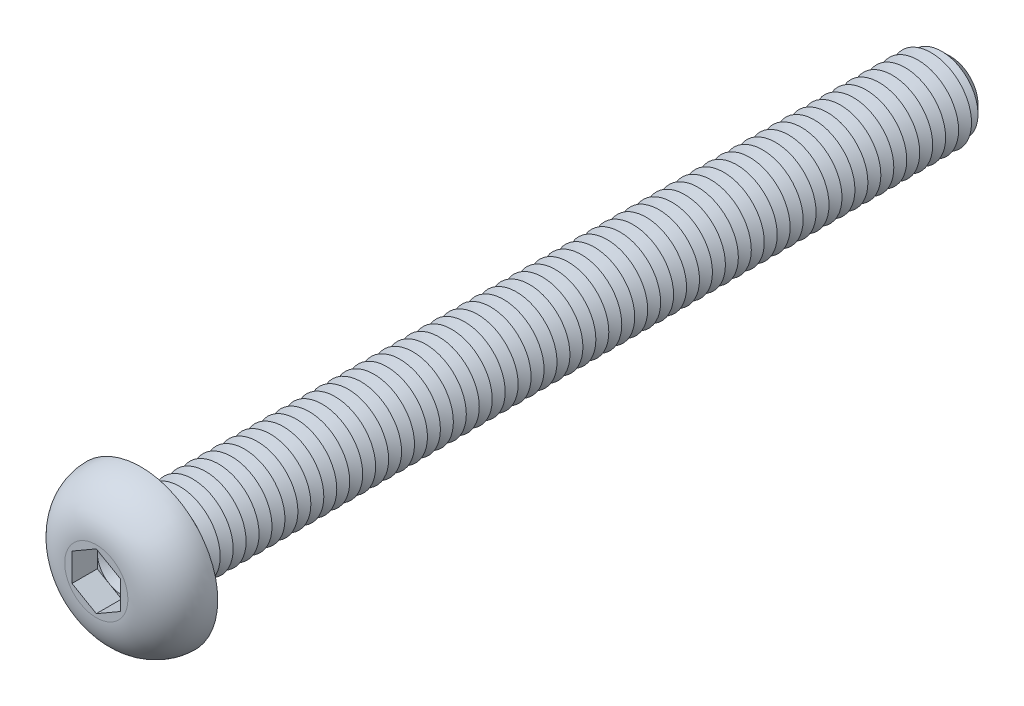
ISO-10303-21;
HEADER;
FILE_DESCRIPTION(('STEP AP214'),'2;1');
FILE_NAME('part.step','',(''),(''),'','','');
FILE_SCHEMA(('AUTOMOTIVE_DESIGN { 1 0 10303 214 1 1 1 1 }'));
ENDSEC;
DATA;
#1=APPLICATION_CONTEXT('core data for automotive mechanical design processes');
#2=APPLICATION_PROTOCOL_DEFINITION('international standard','automotive_design',2000,#1);
#3=PRODUCT_CONTEXT('',#1,'mechanical');
#4=PRODUCT('Part','Part','',(#3));
#5=PRODUCT_RELATED_PRODUCT_CATEGORY('part','',(#4));
#6=PRODUCT_DEFINITION_FORMATION('','',#4);
#7=PRODUCT_DEFINITION_CONTEXT('part definition',#1,'design');
#8=PRODUCT_DEFINITION('design','',#6,#7);
#9=PRODUCT_DEFINITION_SHAPE('','',#8);
#10=(LENGTH_UNIT() NAMED_UNIT(*) SI_UNIT(.MILLI.,.METRE.));
#11=(NAMED_UNIT(*) PLANE_ANGLE_UNIT() SI_UNIT($,.RADIAN.));
#12=(NAMED_UNIT(*) SI_UNIT($,.STERADIAN.) SOLID_ANGLE_UNIT());
#13=UNCERTAINTY_MEASURE_WITH_UNIT(LENGTH_MEASURE(1.E-05),#10,'distance_accuracy_value','');
#14=(GEOMETRIC_REPRESENTATION_CONTEXT(3) GLOBAL_UNCERTAINTY_ASSIGNED_CONTEXT((#13)) GLOBAL_UNIT_ASSIGNED_CONTEXT((#10,
#11,#12)) REPRESENTATION_CONTEXT('',''));
#15=CARTESIAN_POINT('',(0.,0.,0.));
#16=DIRECTION('',(0.,0.,1.));
#17=DIRECTION('',(1.,0.,0.));
#18=AXIS2_PLACEMENT_3D('',#15,#16,#17);
#19=CARTESIAN_POINT('',(0.,0.,1.19));
#20=DIRECTION('',(0.,0.,1.));
#21=DIRECTION('',(1.,0.,0.));
#22=AXIS2_PLACEMENT_3D('',#19,#20,#21);
#23=PLANE('',#22);
#24=CARTESIAN_POINT('',(0.,0.,1.19));
#25=DIRECTION('',(0.,0.,1.));
#26=DIRECTION('',(1.,0.,0.));
#27=AXIS2_PLACEMENT_3D('',#24,#25,#26);
#28=CIRCLE('',#27,1.5);
#29=CARTESIAN_POINT('',(1.5,0.,1.19));
#30=VERTEX_POINT('',#29);
#31=CARTESIAN_POINT('',(0.75,1.29903810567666,1.19));
#32=VERTEX_POINT('',#31);
#33=EDGE_CURVE('E117',#30,#32,#28,.T.);
#34=ORIENTED_EDGE('',*,*,#33,.F.);
#35=DIRECTION('',(0.,1.,0.));
#36=VECTOR('',#35,1.);
#37=CARTESIAN_POINT('',(1.5,-0.866025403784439,1.19));
#38=LINE('',#37,#36);
#39=CARTESIAN_POINT('',(1.5,0.86602540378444,1.19));
#40=VERTEX_POINT('',#39);
#41=EDGE_CURVE('E140',#30,#40,#38,.T.);
#42=ORIENTED_EDGE('',*,*,#41,.T.);
#43=DIRECTION('',(-0.866025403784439,0.5,0.));
#44=VECTOR('',#43,1.);
#45=CARTESIAN_POINT('',(1.5,0.86602540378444,1.19));
#46=LINE('',#45,#44);
#47=EDGE_CURVE('E135',#40,#32,#46,.T.);
#48=ORIENTED_EDGE('',*,*,#47,.T.);
#49=EDGE_LOOP('',(#34,#42,#48));
#50=FACE_BOUND('',#49,.T.);
#51=ADVANCED_FACE('F39',(#50),#23,.T.);
#52=CARTESIAN_POINT('',(0.,0.,1.19));
#53=DIRECTION('',(0.,0.,1.));
#54=DIRECTION('',(1.,0.,0.));
#55=AXIS2_PLACEMENT_3D('',#52,#53,#54);
#56=CIRCLE('',#55,1.5);
#57=CARTESIAN_POINT('',(-0.75,1.29903810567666,1.19));
#58=VERTEX_POINT('',#57);
#59=EDGE_CURVE('E11',#32,#58,#56,.T.);
#60=ORIENTED_EDGE('',*,*,#59,.F.);
#61=CARTESIAN_POINT('',(0.,1.73205080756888,1.19));
#62=VERTEX_POINT('',#61);
#63=EDGE_CURVE('E130',#32,#62,#46,.T.);
#64=ORIENTED_EDGE('',*,*,#63,.T.);
#65=DIRECTION('',(-0.866025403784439,-0.5,0.));
#66=VECTOR('',#65,1.);
#67=CARTESIAN_POINT('',(0.,1.73205080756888,1.19));
#68=LINE('',#67,#66);
#69=EDGE_CURVE('E132',#62,#58,#68,.T.);
#70=ORIENTED_EDGE('',*,*,#69,.T.);
#71=EDGE_LOOP('',(#60,#64,#70));
#72=FACE_BOUND('',#71,.T.);
#73=ADVANCED_FACE('F129',(#72),#23,.T.);
#74=CARTESIAN_POINT('',(-1.5,0.,1.19));
#75=VERTEX_POINT('',#74);
#76=EDGE_CURVE('E49',#58,#75,#56,.T.);
#77=ORIENTED_EDGE('',*,*,#76,.F.);
#78=CARTESIAN_POINT('',(-1.5,0.866025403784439,1.19));
#79=VERTEX_POINT('',#78);
#80=EDGE_CURVE('E143',#58,#79,#68,.T.);
#81=ORIENTED_EDGE('',*,*,#80,.T.);
#82=DIRECTION('',(0.,-1.,0.));
#83=VECTOR('',#82,1.);
#84=CARTESIAN_POINT('',(-1.5,0.866025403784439,1.19));
#85=LINE('',#84,#83);
#86=EDGE_CURVE('E153',#79,#75,#85,.T.);
#87=ORIENTED_EDGE('',*,*,#86,.T.);
#88=EDGE_LOOP('',(#77,#81,#87));
#89=FACE_BOUND('',#88,.T.);
#90=ADVANCED_FACE('F257',(#89),#23,.T.);
#91=CARTESIAN_POINT('',(-0.75,-1.29903810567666,1.19));
#92=VERTEX_POINT('',#91);
#93=EDGE_CURVE('E238',#75,#92,#56,.T.);
#94=ORIENTED_EDGE('',*,*,#93,.F.);
#95=CARTESIAN_POINT('',(-1.5,-0.866025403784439,1.19));
#96=VERTEX_POINT('',#95);
#97=EDGE_CURVE('E152',#75,#96,#85,.T.);
#98=ORIENTED_EDGE('',*,*,#97,.T.);
#99=DIRECTION('',(0.866025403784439,-0.5,0.));
#100=VECTOR('',#99,1.);
#101=CARTESIAN_POINT('',(-1.5,-0.866025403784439,1.19));
#102=LINE('',#101,#100);
#103=EDGE_CURVE('E158',#96,#92,#102,.T.);
#104=ORIENTED_EDGE('',*,*,#103,.T.);
#105=EDGE_LOOP('',(#94,#98,#104));
#106=FACE_BOUND('',#105,.T.);
#107=ADVANCED_FACE('F250',(#106),#23,.T.);
#108=CARTESIAN_POINT('',(0.75,-1.29903810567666,1.19));
#109=VERTEX_POINT('',#108);
#110=EDGE_CURVE('E56',#92,#109,#56,.T.);
#111=ORIENTED_EDGE('',*,*,#110,.F.);
#112=CARTESIAN_POINT('',(0.,-1.73205080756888,1.19));
#113=VERTEX_POINT('',#112);
#114=EDGE_CURVE('E157',#92,#113,#102,.T.);
#115=ORIENTED_EDGE('',*,*,#114,.T.);
#116=DIRECTION('',(0.866025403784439,0.5,0.));
#117=VECTOR('',#116,1.);
#118=CARTESIAN_POINT('',(0.,-1.73205080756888,1.19));
#119=LINE('',#118,#117);
#120=EDGE_CURVE('E163',#113,#109,#119,.T.);
#121=ORIENTED_EDGE('',*,*,#120,.T.);
#122=EDGE_LOOP('',(#111,#115,#121));
#123=FACE_BOUND('',#122,.T.);
#124=ADVANCED_FACE('F461',(#123),#23,.T.);
#125=CARTESIAN_POINT('',(0.,0.,-50.));
#126=DIRECTION('',(0.,0.,1.));
#127=DIRECTION('',(1.,0.,0.));
#128=AXIS2_PLACEMENT_3D('',#125,#126,#127);
#129=CYLINDRICAL_SURFACE('',#128,2.5);
#130=CARTESIAN_POINT('',(0.,0.,-0.399999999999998));
#131=DIRECTION('',(0.,0.,1.));
#132=DIRECTION('',(1.,0.,0.));
#133=AXIS2_PLACEMENT_3D('',#130,#131,#132);
#134=CIRCLE('',#133,2.5);
#135=CARTESIAN_POINT('',(2.5,0.,-0.399999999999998));
#136=VERTEX_POINT('',#135);
#137=EDGE_CURVE('E220',#136,#136,#134,.F.);
#138=ORIENTED_EDGE('',*,*,#137,.T.);
#139=EDGE_LOOP('',(#138));
#140=FACE_BOUND('',#139,.T.);
#141=CARTESIAN_POINT('',(0.,0.,-0.800000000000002));
#142=DIRECTION('',(0.,0.,1.));
#143=DIRECTION('',(1.,0.,0.));
#144=AXIS2_PLACEMENT_3D('',#141,#142,#143);
#145=CIRCLE('',#144,2.5);
#146=CARTESIAN_POINT('',(2.5,0.,-0.800000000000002));
#147=VERTEX_POINT('',#146);
#148=EDGE_CURVE('E148',#147,#147,#145,.T.);
#149=ORIENTED_EDGE('',*,*,#148,.T.);
#150=EDGE_LOOP('',(#149));
#151=FACE_BOUND('',#150,.T.);
#152=ADVANCED_FACE('F445',(#140,#151),#129,.T.);
#153=CARTESIAN_POINT('',(0.,4.75,0.));
#154=DIRECTION('',(0.,0.,1.));
#155=DIRECTION('',(1.,0.,0.));
#156=AXIS2_PLACEMENT_3D('',#153,#154,#155);
#157=PLANE('',#156);
#158=CARTESIAN_POINT('',(0.,0.,0.));
#159=DIRECTION('',(0.,0.,1.));
#160=DIRECTION('',(1.,0.,0.));
#161=AXIS2_PLACEMENT_3D('',#158,#159,#160);
#162=CIRCLE('',#161,2.9);
#163=CARTESIAN_POINT('',(2.9,0.,0.));
#164=VERTEX_POINT('',#163);
#165=EDGE_CURVE('E229',#164,#164,#162,.T.);
#166=ORIENTED_EDGE('',*,*,#165,.T.);
#167=EDGE_LOOP('',(#166));
#168=FACE_BOUND('',#167,.T.);
#169=CARTESIAN_POINT('',(0.,0.,0.));
#170=DIRECTION('',(0.,0.,1.));
#171=DIRECTION('',(1.,0.,0.));
#172=AXIS2_PLACEMENT_3D('',#169,#170,#171);
#173=CIRCLE('',#172,4.75);
#174=CARTESIAN_POINT('',(4.75,0.,0.));
#175=VERTEX_POINT('',#174);
#176=EDGE_CURVE('E195',#175,#175,#173,.T.);
#177=ORIENTED_EDGE('',*,*,#176,.F.);
#178=EDGE_LOOP('',(#177));
#179=FACE_BOUND('',#178,.T.);
#180=ADVANCED_FACE('F491',(#168,#179),#157,.F.);
#181=CARTESIAN_POINT('',(0.,0.,2.75));
#182=DIRECTION('',(0.,0.,-1.));
#183=DIRECTION('',(-1.,0.,0.));
#184=AXIS2_PLACEMENT_3D('',#181,#182,#183);
#185=PLANE('',#184);
#186=DIRECTION('',(-0.866025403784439,-0.5,0.));
#187=VECTOR('',#186,1.);
#188=CARTESIAN_POINT('',(0.,1.73205080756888,2.75));
#189=LINE('',#188,#187);
#190=CARTESIAN_POINT('',(0.,1.73205080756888,2.75));
#191=VERTEX_POINT('',#190);
#192=CARTESIAN_POINT('',(-1.5,0.866025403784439,2.75));
#193=VERTEX_POINT('',#192);
#194=EDGE_CURVE('E173',#191,#193,#189,.T.);
#195=ORIENTED_EDGE('',*,*,#194,.F.);
#196=DIRECTION('',(-0.866025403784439,0.5,0.));
#197=VECTOR('',#196,1.);
#198=CARTESIAN_POINT('',(1.5,0.86602540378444,2.75));
#199=LINE('',#198,#197);
#200=CARTESIAN_POINT('',(1.5,0.86602540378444,2.75));
#201=VERTEX_POINT('',#200);
#202=EDGE_CURVE('E64',#201,#191,#199,.T.);
#203=ORIENTED_EDGE('',*,*,#202,.F.);
#204=DIRECTION('',(0.,1.,0.));
#205=VECTOR('',#204,1.);
#206=CARTESIAN_POINT('',(1.5,-0.866025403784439,2.75));
#207=LINE('',#206,#205);
#208=CARTESIAN_POINT('',(1.5,-0.866025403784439,2.75));
#209=VERTEX_POINT('',#208);
#210=EDGE_CURVE('E138',#209,#201,#207,.T.);
#211=ORIENTED_EDGE('',*,*,#210,.F.);
#212=DIRECTION('',(0.866025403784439,0.5,0.));
#213=VECTOR('',#212,1.);
#214=CARTESIAN_POINT('',(0.,-1.73205080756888,2.75));
#215=LINE('',#214,#213);
#216=CARTESIAN_POINT('',(0.,-1.73205080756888,2.75));
#217=VERTEX_POINT('',#216);
#218=EDGE_CURVE('E185',#217,#209,#215,.T.);
#219=ORIENTED_EDGE('',*,*,#218,.F.);
#220=DIRECTION('',(0.866025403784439,-0.5,0.));
#221=VECTOR('',#220,1.);
#222=CARTESIAN_POINT('',(-1.5,-0.866025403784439,2.75));
#223=LINE('',#222,#221);
#224=CARTESIAN_POINT('',(-1.5,-0.866025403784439,2.75));
#225=VERTEX_POINT('',#224);
#226=EDGE_CURVE('E181',#225,#217,#223,.T.);
#227=ORIENTED_EDGE('',*,*,#226,.F.);
#228=DIRECTION('',(0.,-1.,0.));
#229=VECTOR('',#228,1.);
#230=CARTESIAN_POINT('',(-1.5,0.866025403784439,2.75));
#231=LINE('',#230,#229);
#232=EDGE_CURVE('E177',#193,#225,#231,.T.);
#233=ORIENTED_EDGE('',*,*,#232,.F.);
#234=EDGE_LOOP('',(#195,#203,#211,#219,#227,#233));
#235=FACE_BOUND('',#234,.T.);
#236=CARTESIAN_POINT('',(0.,0.,2.75));
#237=DIRECTION('',(0.,0.,1.));
#238=DIRECTION('',(1.,0.,0.));
#239=AXIS2_PLACEMENT_3D('',#236,#237,#238);
#240=CIRCLE('',#239,1.95044646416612);
#241=CARTESIAN_POINT('',(1.95044646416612,0.,2.75));
#242=VERTEX_POINT('',#241);
#243=EDGE_CURVE('E213',#242,#242,#240,.T.);
#244=ORIENTED_EDGE('',*,*,#243,.T.);
#245=EDGE_LOOP('',(#244));
#246=FACE_BOUND('',#245,.T.);
#247=ADVANCED_FACE('F266',(#235,#246),#185,.F.);
#248=CARTESIAN_POINT('',(0.,0.,-0.0500000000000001));
#249=DIRECTION('',(0.,0.,1.));
#250=DIRECTION('',(1.,0.,0.));
#251=AXIS2_PLACEMENT_3D('',#248,#249,#250);
#252=DEGENERATE_TOROIDAL_SURFACE('',#251,1.95044646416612,2.8,.T.);
#253=ORIENTED_EDGE('',*,*,#243,.F.);
#254=EDGE_LOOP('',(#253));
#255=FACE_BOUND('',#254,.T.);
#256=ORIENTED_EDGE('',*,*,#176,.T.);
#257=EDGE_LOOP('',(#256));
#258=FACE_BOUND('',#257,.T.);
#259=ADVANCED_FACE('F485',(#255,#258),#252,.T.);
#260=CARTESIAN_POINT('',(1.5,0.86602540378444,1.19));
#261=DIRECTION('',(0.5,0.866025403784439,0.));
#262=DIRECTION('',(-0.866025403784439,0.5,0.));
#263=AXIS2_PLACEMENT_3D('',#260,#261,#262);
#264=PLANE('',#263);
#265=ORIENTED_EDGE('',*,*,#202,.T.);
#266=DIRECTION('',(0.,0.,1.));
#267=VECTOR('',#266,1.);
#268=CARTESIAN_POINT('',(0.,1.73205080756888,1.19));
#269=LINE('',#268,#267);
#270=EDGE_CURVE('E136',#62,#191,#269,.T.);
#271=ORIENTED_EDGE('',*,*,#270,.F.);
#272=ORIENTED_EDGE('',*,*,#63,.F.);
#273=ORIENTED_EDGE('',*,*,#47,.F.);
#274=DIRECTION('',(0.,0.,1.));
#275=VECTOR('',#274,1.);
#276=CARTESIAN_POINT('',(1.5,0.86602540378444,1.19));
#277=LINE('',#276,#275);
#278=EDGE_CURVE('E192',#40,#201,#277,.T.);
#279=ORIENTED_EDGE('',*,*,#278,.T.);
#280=EDGE_LOOP('',(#265,#271,#272,#273,#279));
#281=FACE_BOUND('',#280,.T.);
#282=ADVANCED_FACE('F134',(#281),#264,.F.);
#283=CARTESIAN_POINT('',(1.5,-0.866025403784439,1.19));
#284=DIRECTION('',(1.,0.,0.));
#285=DIRECTION('',(0.,1.,0.));
#286=AXIS2_PLACEMENT_3D('',#283,#284,#285);
#287=PLANE('',#286);
#288=ORIENTED_EDGE('',*,*,#210,.T.);
#289=ORIENTED_EDGE('',*,*,#278,.F.);
#290=ORIENTED_EDGE('',*,*,#41,.F.);
#291=CARTESIAN_POINT('',(1.5,-0.866025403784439,1.19));
#292=VERTEX_POINT('',#291);
#293=EDGE_CURVE('E167',#292,#30,#38,.T.);
#294=ORIENTED_EDGE('',*,*,#293,.F.);
#295=DIRECTION('',(0.,0.,1.));
#296=VECTOR('',#295,1.);
#297=CARTESIAN_POINT('',(1.5,-0.866025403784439,1.19));
#298=LINE('',#297,#296);
#299=EDGE_CURVE('E196',#292,#209,#298,.T.);
#300=ORIENTED_EDGE('',*,*,#299,.T.);
#301=EDGE_LOOP('',(#288,#289,#290,#294,#300));
#302=FACE_BOUND('',#301,.T.);
#303=ADVANCED_FACE('F469',(#302),#287,.F.);
#304=CARTESIAN_POINT('',(0.,-1.73205080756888,1.19));
#305=DIRECTION('',(0.5,-0.866025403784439,0.));
#306=DIRECTION('',(0.866025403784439,0.5,0.));
#307=AXIS2_PLACEMENT_3D('',#304,#305,#306);
#308=PLANE('',#307);
#309=ORIENTED_EDGE('',*,*,#218,.T.);
#310=ORIENTED_EDGE('',*,*,#299,.F.);
#311=EDGE_CURVE('E162',#109,#292,#119,.T.);
#312=ORIENTED_EDGE('',*,*,#311,.F.);
#313=ORIENTED_EDGE('',*,*,#120,.F.);
#314=DIRECTION('',(0.,0.,1.));
#315=VECTOR('',#314,1.);
#316=CARTESIAN_POINT('',(0.,-1.73205080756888,1.19));
#317=LINE('',#316,#315);
#318=EDGE_CURVE('E199',#113,#217,#317,.T.);
#319=ORIENTED_EDGE('',*,*,#318,.T.);
#320=EDGE_LOOP('',(#309,#310,#312,#313,#319));
#321=FACE_BOUND('',#320,.T.);
#322=ADVANCED_FACE('F472',(#321),#308,.F.);
#323=CARTESIAN_POINT('',(-1.5,-0.866025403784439,1.19));
#324=DIRECTION('',(-0.5,-0.866025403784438,0.));
#325=DIRECTION('',(0.866025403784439,-0.5,0.));
#326=AXIS2_PLACEMENT_3D('',#323,#324,#325);
#327=PLANE('',#326);
#328=ORIENTED_EDGE('',*,*,#226,.T.);
#329=ORIENTED_EDGE('',*,*,#318,.F.);
#330=ORIENTED_EDGE('',*,*,#114,.F.);
#331=ORIENTED_EDGE('',*,*,#103,.F.);
#332=DIRECTION('',(0.,0.,1.));
#333=VECTOR('',#332,1.);
#334=CARTESIAN_POINT('',(-1.5,-0.866025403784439,1.19));
#335=LINE('',#334,#333);
#336=EDGE_CURVE('E202',#96,#225,#335,.T.);
#337=ORIENTED_EDGE('',*,*,#336,.T.);
#338=EDGE_LOOP('',(#328,#329,#330,#331,#337));
#339=FACE_BOUND('',#338,.T.);
#340=ADVANCED_FACE('F271',(#339),#327,.F.);
#341=CARTESIAN_POINT('',(-1.5,0.866025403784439,1.19));
#342=DIRECTION('',(-1.,0.,0.));
#343=DIRECTION('',(0.,-1.,0.));
#344=AXIS2_PLACEMENT_3D('',#341,#342,#343);
#345=PLANE('',#344);
#346=ORIENTED_EDGE('',*,*,#232,.T.);
#347=ORIENTED_EDGE('',*,*,#336,.F.);
#348=ORIENTED_EDGE('',*,*,#97,.F.);
#349=ORIENTED_EDGE('',*,*,#86,.F.);
#350=DIRECTION('',(0.,0.,1.));
#351=VECTOR('',#350,1.);
#352=CARTESIAN_POINT('',(-1.5,0.866025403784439,1.19));
#353=LINE('',#352,#351);
#354=EDGE_CURVE('E205',#79,#193,#353,.T.);
#355=ORIENTED_EDGE('',*,*,#354,.T.);
#356=EDGE_LOOP('',(#346,#347,#348,#349,#355));
#357=FACE_BOUND('',#356,.T.);
#358=ADVANCED_FACE('F255',(#357),#345,.F.);
#359=CARTESIAN_POINT('',(0.,1.73205080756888,1.19));
#360=DIRECTION('',(-0.5,0.866025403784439,0.));
#361=DIRECTION('',(-0.866025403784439,-0.5,0.));
#362=AXIS2_PLACEMENT_3D('',#359,#360,#361);
#363=PLANE('',#362);
#364=ORIENTED_EDGE('',*,*,#194,.T.);
#365=ORIENTED_EDGE('',*,*,#354,.F.);
#366=ORIENTED_EDGE('',*,*,#80,.F.);
#367=ORIENTED_EDGE('',*,*,#69,.F.);
#368=ORIENTED_EDGE('',*,*,#270,.T.);
#369=EDGE_LOOP('',(#364,#365,#366,#367,#368));
#370=FACE_BOUND('',#369,.T.);
#371=ADVANCED_FACE('F260',(#370),#363,.F.);
#372=EDGE_CURVE('E43',#109,#30,#56,.T.);
#373=ORIENTED_EDGE('',*,*,#372,.F.);
#374=ORIENTED_EDGE('',*,*,#311,.T.);
#375=ORIENTED_EDGE('',*,*,#293,.T.);
#376=EDGE_LOOP('',(#373,#374,#375));
#377=FACE_BOUND('',#376,.T.);
#378=ADVANCED_FACE('F450',(#377),#23,.T.);
#379=CARTESIAN_POINT('',(0.,0.,-0.800000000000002));
#380=DIRECTION('',(0.,0.,1.));
#381=DIRECTION('',(1.,0.,0.));
#382=AXIS2_PLACEMENT_3D('',#379,#380,#381);
#383=CONICAL_SURFACE('',#382,2.5,1.0471975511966);
#384=CARTESIAN_POINT('',(0.,0.,-1.2));
#385=DIRECTION('',(0.,0.,1.));
#386=DIRECTION('',(1.,0.,0.));
#387=AXIS2_PLACEMENT_3D('',#384,#385,#386);
#388=CIRCLE('',#387,1.80717967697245);
#389=CARTESIAN_POINT('',(1.80717967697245,0.,-1.2));
#390=VERTEX_POINT('',#389);
#391=EDGE_CURVE('E437',#390,#390,#388,.T.);
#392=ORIENTED_EDGE('',*,*,#391,.T.);
#393=EDGE_LOOP('',(#392));
#394=FACE_BOUND('',#393,.T.);
#395=ORIENTED_EDGE('',*,*,#148,.F.);
#396=EDGE_LOOP('',(#395));
#397=FACE_BOUND('',#396,.T.);
#398=ADVANCED_FACE('F447',(#394,#397),#383,.T.);
#399=CARTESIAN_POINT('',(0.,0.,-1.2));
#400=DIRECTION('',(0.,0.,-1.));
#401=DIRECTION('',(-1.,0.,0.));
#402=AXIS2_PLACEMENT_3D('',#399,#400,#401);
#403=CONICAL_SURFACE('',#402,1.80717967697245,1.04719755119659);
#404=CARTESIAN_POINT('',(0.,0.,-1.6));
#405=DIRECTION('',(0.,0.,1.));
#406=DIRECTION('',(1.,0.,0.));
#407=AXIS2_PLACEMENT_3D('',#404,#405,#406);
#408=CIRCLE('',#407,2.5);
#409=CARTESIAN_POINT('',(2.5,0.,-1.6));
#410=VERTEX_POINT('',#409);
#411=EDGE_CURVE('E305',#410,#410,#408,.T.);
#412=ORIENTED_EDGE('',*,*,#411,.T.);
#413=EDGE_LOOP('',(#412));
#414=FACE_BOUND('',#413,.T.);
#415=ORIENTED_EDGE('',*,*,#391,.F.);
#416=EDGE_LOOP('',(#415));
#417=FACE_BOUND('',#416,.T.);
#418=ADVANCED_FACE('F449',(#414,#417),#403,.T.);
#419=CARTESIAN_POINT('',(0.,0.,-1.6));
#420=DIRECTION('',(0.,0.,1.));
#421=DIRECTION('',(1.,0.,0.));
#422=AXIS2_PLACEMENT_3D('',#419,#420,#421);
#423=CONICAL_SURFACE('',#422,2.5,1.0471975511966);
#424=CARTESIAN_POINT('',(0.,0.,-2.));
#425=DIRECTION('',(0.,0.,1.));
#426=DIRECTION('',(1.,0.,0.));
#427=AXIS2_PLACEMENT_3D('',#424,#425,#426);
#428=CIRCLE('',#427,1.80717967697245);
#429=CARTESIAN_POINT('',(1.80717967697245,0.,-2.));
#430=VERTEX_POINT('',#429);
#431=EDGE_CURVE('E303',#430,#430,#428,.T.);
#432=ORIENTED_EDGE('',*,*,#431,.T.);
#433=EDGE_LOOP('',(#432));
#434=FACE_BOUND('',#433,.T.);
#435=ORIENTED_EDGE('',*,*,#411,.F.);
#436=EDGE_LOOP('',(#435));
#437=FACE_BOUND('',#436,.T.);
#438=ADVANCED_FACE('F456',(#434,#437),#423,.T.);
#439=CARTESIAN_POINT('',(0.,0.,-2.));
#440=DIRECTION('',(0.,0.,-1.));
#441=DIRECTION('',(-1.,0.,0.));
#442=AXIS2_PLACEMENT_3D('',#439,#440,#441);
#443=CONICAL_SURFACE('',#442,1.80717967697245,1.04719755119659);
#444=CARTESIAN_POINT('',(0.,0.,-2.4));
#445=DIRECTION('',(0.,0.,1.));
#446=DIRECTION('',(1.,0.,0.));
#447=AXIS2_PLACEMENT_3D('',#444,#445,#446);
#448=CIRCLE('',#447,2.5);
#449=CARTESIAN_POINT('',(2.5,0.,-2.4));
#450=VERTEX_POINT('',#449);
#451=EDGE_CURVE('E306',#450,#450,#448,.T.);
#452=ORIENTED_EDGE('',*,*,#451,.T.);
#453=EDGE_LOOP('',(#452));
#454=FACE_BOUND('',#453,.T.);
#455=ORIENTED_EDGE('',*,*,#431,.F.);
#456=EDGE_LOOP('',(#455));
#457=FACE_BOUND('',#456,.T.);
#458=ADVANCED_FACE('F901',(#454,#457),#443,.T.);
#459=CARTESIAN_POINT('',(0.,0.,-2.4));
#460=DIRECTION('',(0.,0.,1.));
#461=DIRECTION('',(1.,0.,0.));
#462=AXIS2_PLACEMENT_3D('',#459,#460,#461);
#463=CONICAL_SURFACE('',#462,2.5,1.0471975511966);
#464=CARTESIAN_POINT('',(0.,0.,-2.8));
#465=DIRECTION('',(0.,0.,1.));
#466=DIRECTION('',(1.,0.,0.));
#467=AXIS2_PLACEMENT_3D('',#464,#465,#466);
#468=CIRCLE('',#467,1.80717967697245);
#469=CARTESIAN_POINT('',(1.80717967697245,0.,-2.8));
#470=VERTEX_POINT('',#469);
#471=EDGE_CURVE('E428',#470,#470,#468,.T.);
#472=ORIENTED_EDGE('',*,*,#471,.T.);
#473=EDGE_LOOP('',(#472));
#474=FACE_BOUND('',#473,.T.);
#475=ORIENTED_EDGE('',*,*,#451,.F.);
#476=EDGE_LOOP('',(#475));
#477=FACE_BOUND('',#476,.T.);
#478=ADVANCED_FACE('F897',(#474,#477),#463,.T.);
#479=CARTESIAN_POINT('',(0.,0.,-2.8));
#480=DIRECTION('',(0.,0.,-1.));
#481=DIRECTION('',(-1.,0.,0.));
#482=AXIS2_PLACEMENT_3D('',#479,#480,#481);
#483=CONICAL_SURFACE('',#482,1.80717967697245,1.04719755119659);
#484=CARTESIAN_POINT('',(0.,0.,-3.2));
#485=DIRECTION('',(0.,0.,1.));
#486=DIRECTION('',(1.,0.,0.));
#487=AXIS2_PLACEMENT_3D('',#484,#485,#486);
#488=CIRCLE('',#487,2.5);
#489=CARTESIAN_POINT('',(2.5,0.,-3.2));
#490=VERTEX_POINT('',#489);
#491=EDGE_CURVE('E424',#490,#490,#488,.T.);
#492=ORIENTED_EDGE('',*,*,#491,.T.);
#493=EDGE_LOOP('',(#492));
#494=FACE_BOUND('',#493,.T.);
#495=ORIENTED_EDGE('',*,*,#471,.F.);
#496=EDGE_LOOP('',(#495));
#497=FACE_BOUND('',#496,.T.);
#498=ADVANCED_FACE('F893',(#494,#497),#483,.T.);
#499=CARTESIAN_POINT('',(0.,0.,-3.2));
#500=DIRECTION('',(0.,0.,1.));
#501=DIRECTION('',(1.,0.,0.));
#502=AXIS2_PLACEMENT_3D('',#499,#500,#501);
#503=CONICAL_SURFACE('',#502,2.5,1.0471975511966);
#504=CARTESIAN_POINT('',(0.,0.,-3.6));
#505=DIRECTION('',(0.,0.,1.));
#506=DIRECTION('',(1.,0.,0.));
#507=AXIS2_PLACEMENT_3D('',#504,#505,#506);
#508=CIRCLE('',#507,1.80717967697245);
#509=CARTESIAN_POINT('',(1.80717967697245,0.,-3.6));
#510=VERTEX_POINT('',#509);
#511=EDGE_CURVE('E420',#510,#510,#508,.T.);
#512=ORIENTED_EDGE('',*,*,#511,.T.);
#513=EDGE_LOOP('',(#512));
#514=FACE_BOUND('',#513,.T.);
#515=ORIENTED_EDGE('',*,*,#491,.F.);
#516=EDGE_LOOP('',(#515));
#517=FACE_BOUND('',#516,.T.);
#518=ADVANCED_FACE('F889',(#514,#517),#503,.T.);
#519=CARTESIAN_POINT('',(0.,0.,-3.6));
#520=DIRECTION('',(0.,0.,-1.));
#521=DIRECTION('',(-1.,0.,0.));
#522=AXIS2_PLACEMENT_3D('',#519,#520,#521);
#523=CONICAL_SURFACE('',#522,1.80717967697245,1.04719755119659);
#524=CARTESIAN_POINT('',(0.,0.,-4.));
#525=DIRECTION('',(0.,0.,1.));
#526=DIRECTION('',(1.,0.,0.));
#527=AXIS2_PLACEMENT_3D('',#524,#525,#526);
#528=CIRCLE('',#527,2.5);
#529=CARTESIAN_POINT('',(2.5,0.,-4.));
#530=VERTEX_POINT('',#529);
#531=EDGE_CURVE('E416',#530,#530,#528,.T.);
#532=ORIENTED_EDGE('',*,*,#531,.T.);
#533=EDGE_LOOP('',(#532));
#534=FACE_BOUND('',#533,.T.);
#535=ORIENTED_EDGE('',*,*,#511,.F.);
#536=EDGE_LOOP('',(#535));
#537=FACE_BOUND('',#536,.T.);
#538=ADVANCED_FACE('F885',(#534,#537),#523,.T.);
#539=CARTESIAN_POINT('',(0.,0.,-4.));
#540=DIRECTION('',(0.,0.,1.));
#541=DIRECTION('',(1.,0.,0.));
#542=AXIS2_PLACEMENT_3D('',#539,#540,#541);
#543=CONICAL_SURFACE('',#542,2.5,1.0471975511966);
#544=CARTESIAN_POINT('',(0.,0.,-4.4));
#545=DIRECTION('',(0.,0.,1.));
#546=DIRECTION('',(1.,0.,0.));
#547=AXIS2_PLACEMENT_3D('',#544,#545,#546);
#548=CIRCLE('',#547,1.80717967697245);
#549=CARTESIAN_POINT('',(1.80717967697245,0.,-4.4));
#550=VERTEX_POINT('',#549);
#551=EDGE_CURVE('E413',#550,#550,#548,.T.);
#552=ORIENTED_EDGE('',*,*,#551,.T.);
#553=EDGE_LOOP('',(#552));
#554=FACE_BOUND('',#553,.T.);
#555=ORIENTED_EDGE('',*,*,#531,.F.);
#556=EDGE_LOOP('',(#555));
#557=FACE_BOUND('',#556,.T.);
#558=ADVANCED_FACE('F881',(#554,#557),#543,.T.);
#559=CARTESIAN_POINT('',(0.,0.,-4.4));
#560=DIRECTION('',(0.,0.,-1.));
#561=DIRECTION('',(-1.,0.,0.));
#562=AXIS2_PLACEMENT_3D('',#559,#560,#561);
#563=CONICAL_SURFACE('',#562,1.80717967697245,1.04719755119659);
#564=CARTESIAN_POINT('',(0.,0.,-4.8));
#565=DIRECTION('',(0.,0.,1.));
#566=DIRECTION('',(1.,0.,0.));
#567=AXIS2_PLACEMENT_3D('',#564,#565,#566);
#568=CIRCLE('',#567,2.5);
#569=CARTESIAN_POINT('',(2.5,0.,-4.8));
#570=VERTEX_POINT('',#569);
#571=EDGE_CURVE('E409',#570,#570,#568,.T.);
#572=ORIENTED_EDGE('',*,*,#571,.T.);
#573=EDGE_LOOP('',(#572));
#574=FACE_BOUND('',#573,.T.);
#575=ORIENTED_EDGE('',*,*,#551,.F.);
#576=EDGE_LOOP('',(#575));
#577=FACE_BOUND('',#576,.T.);
#578=ADVANCED_FACE('F877',(#574,#577),#563,.T.);
#579=CARTESIAN_POINT('',(0.,0.,-4.8));
#580=DIRECTION('',(0.,0.,1.));
#581=DIRECTION('',(1.,0.,0.));
#582=AXIS2_PLACEMENT_3D('',#579,#580,#581);
#583=CONICAL_SURFACE('',#582,2.5,1.0471975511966);
#584=CARTESIAN_POINT('',(0.,0.,-5.2));
#585=DIRECTION('',(0.,0.,1.));
#586=DIRECTION('',(1.,0.,0.));
#587=AXIS2_PLACEMENT_3D('',#584,#585,#586);
#588=CIRCLE('',#587,1.80717967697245);
#589=CARTESIAN_POINT('',(1.80717967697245,0.,-5.2));
#590=VERTEX_POINT('',#589);
#591=EDGE_CURVE('E405',#590,#590,#588,.T.);
#592=ORIENTED_EDGE('',*,*,#591,.T.);
#593=EDGE_LOOP('',(#592));
#594=FACE_BOUND('',#593,.T.);
#595=ORIENTED_EDGE('',*,*,#571,.F.);
#596=EDGE_LOOP('',(#595));
#597=FACE_BOUND('',#596,.T.);
#598=ADVANCED_FACE('F873',(#594,#597),#583,.T.);
#599=CARTESIAN_POINT('',(0.,0.,-5.2));
#600=DIRECTION('',(0.,0.,-1.));
#601=DIRECTION('',(-1.,0.,0.));
#602=AXIS2_PLACEMENT_3D('',#599,#600,#601);
#603=CONICAL_SURFACE('',#602,1.80717967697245,1.04719755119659);
#604=CARTESIAN_POINT('',(0.,0.,-5.6));
#605=DIRECTION('',(0.,0.,1.));
#606=DIRECTION('',(1.,0.,0.));
#607=AXIS2_PLACEMENT_3D('',#604,#605,#606);
#608=CIRCLE('',#607,2.5);
#609=CARTESIAN_POINT('',(2.5,0.,-5.6));
#610=VERTEX_POINT('',#609);
#611=EDGE_CURVE('E401',#610,#610,#608,.T.);
#612=ORIENTED_EDGE('',*,*,#611,.T.);
#613=EDGE_LOOP('',(#612));
#614=FACE_BOUND('',#613,.T.);
#615=ORIENTED_EDGE('',*,*,#591,.F.);
#616=EDGE_LOOP('',(#615));
#617=FACE_BOUND('',#616,.T.);
#618=ADVANCED_FACE('F869',(#614,#617),#603,.T.);
#619=CARTESIAN_POINT('',(0.,0.,-5.6));
#620=DIRECTION('',(0.,0.,1.));
#621=DIRECTION('',(1.,0.,0.));
#622=AXIS2_PLACEMENT_3D('',#619,#620,#621);
#623=CONICAL_SURFACE('',#622,2.5,1.0471975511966);
#624=CARTESIAN_POINT('',(0.,0.,-6.));
#625=DIRECTION('',(0.,0.,1.));
#626=DIRECTION('',(1.,0.,0.));
#627=AXIS2_PLACEMENT_3D('',#624,#625,#626);
#628=CIRCLE('',#627,1.80717967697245);
#629=CARTESIAN_POINT('',(1.80717967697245,0.,-6.));
#630=VERTEX_POINT('',#629);
#631=EDGE_CURVE('E397',#630,#630,#628,.T.);
#632=ORIENTED_EDGE('',*,*,#631,.T.);
#633=EDGE_LOOP('',(#632));
#634=FACE_BOUND('',#633,.T.);
#635=ORIENTED_EDGE('',*,*,#611,.F.);
#636=EDGE_LOOP('',(#635));
#637=FACE_BOUND('',#636,.T.);
#638=ADVANCED_FACE('F865',(#634,#637),#623,.T.);
#639=CARTESIAN_POINT('',(0.,0.,-6.));
#640=DIRECTION('',(0.,0.,-1.));
#641=DIRECTION('',(-1.,0.,0.));
#642=AXIS2_PLACEMENT_3D('',#639,#640,#641);
#643=CONICAL_SURFACE('',#642,1.80717967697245,1.04719755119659);
#644=CARTESIAN_POINT('',(0.,0.,-6.4));
#645=DIRECTION('',(0.,0.,1.));
#646=DIRECTION('',(1.,0.,0.));
#647=AXIS2_PLACEMENT_3D('',#644,#645,#646);
#648=CIRCLE('',#647,2.5);
#649=CARTESIAN_POINT('',(2.5,0.,-6.4));
#650=VERTEX_POINT('',#649);
#651=EDGE_CURVE('E393',#650,#650,#648,.T.);
#652=ORIENTED_EDGE('',*,*,#651,.T.);
#653=EDGE_LOOP('',(#652));
#654=FACE_BOUND('',#653,.T.);
#655=ORIENTED_EDGE('',*,*,#631,.F.);
#656=EDGE_LOOP('',(#655));
#657=FACE_BOUND('',#656,.T.);
#658=ADVANCED_FACE('F861',(#654,#657),#643,.T.);
#659=CARTESIAN_POINT('',(0.,0.,-6.4));
#660=DIRECTION('',(0.,0.,1.));
#661=DIRECTION('',(1.,0.,0.));
#662=AXIS2_PLACEMENT_3D('',#659,#660,#661);
#663=CONICAL_SURFACE('',#662,2.5,1.0471975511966);
#664=CARTESIAN_POINT('',(0.,0.,-6.8));
#665=DIRECTION('',(0.,0.,1.));
#666=DIRECTION('',(1.,0.,0.));
#667=AXIS2_PLACEMENT_3D('',#664,#665,#666);
#668=CIRCLE('',#667,1.80717967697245);
#669=CARTESIAN_POINT('',(1.80717967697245,0.,-6.8));
#670=VERTEX_POINT('',#669);
#671=EDGE_CURVE('E383',#670,#670,#668,.T.);
#672=ORIENTED_EDGE('',*,*,#671,.T.);
#673=EDGE_LOOP('',(#672));
#674=FACE_BOUND('',#673,.T.);
#675=ORIENTED_EDGE('',*,*,#651,.F.);
#676=EDGE_LOOP('',(#675));
#677=FACE_BOUND('',#676,.T.);
#678=ADVANCED_FACE('F857',(#674,#677),#663,.T.);
#679=CARTESIAN_POINT('',(0.,0.,-6.8));
#680=DIRECTION('',(0.,0.,-1.));
#681=DIRECTION('',(-1.,0.,0.));
#682=AXIS2_PLACEMENT_3D('',#679,#680,#681);
#683=CONICAL_SURFACE('',#682,1.80717967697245,1.04719755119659);
#684=CARTESIAN_POINT('',(0.,0.,-7.2));
#685=DIRECTION('',(0.,0.,1.));
#686=DIRECTION('',(1.,0.,0.));
#687=AXIS2_PLACEMENT_3D('',#684,#685,#686);
#688=CIRCLE('',#687,2.5);
#689=CARTESIAN_POINT('',(2.5,0.,-7.2));
#690=VERTEX_POINT('',#689);
#691=EDGE_CURVE('E377',#690,#690,#688,.T.);
#692=ORIENTED_EDGE('',*,*,#691,.T.);
#693=EDGE_LOOP('',(#692));
#694=FACE_BOUND('',#693,.T.);
#695=ORIENTED_EDGE('',*,*,#671,.F.);
#696=EDGE_LOOP('',(#695));
#697=FACE_BOUND('',#696,.T.);
#698=ADVANCED_FACE('F854',(#694,#697),#683,.T.);
#699=CARTESIAN_POINT('',(0.,0.,-7.2));
#700=DIRECTION('',(0.,0.,1.));
#701=DIRECTION('',(1.,0.,0.));
#702=AXIS2_PLACEMENT_3D('',#699,#700,#701);
#703=CONICAL_SURFACE('',#702,2.5,1.0471975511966);
#704=CARTESIAN_POINT('',(0.,0.,-7.6));
#705=DIRECTION('',(0.,0.,1.));
#706=DIRECTION('',(1.,0.,0.));
#707=AXIS2_PLACEMENT_3D('',#704,#705,#706);
#708=CIRCLE('',#707,1.80717967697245);
#709=CARTESIAN_POINT('',(1.80717967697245,0.,-7.6));
#710=VERTEX_POINT('',#709);
#711=EDGE_CURVE('E375',#710,#710,#708,.T.);
#712=ORIENTED_EDGE('',*,*,#711,.T.);
#713=EDGE_LOOP('',(#712));
#714=FACE_BOUND('',#713,.T.);
#715=ORIENTED_EDGE('',*,*,#691,.F.);
#716=EDGE_LOOP('',(#715));
#717=FACE_BOUND('',#716,.T.);
#718=ADVANCED_FACE('F850',(#714,#717),#703,.T.);
#719=CARTESIAN_POINT('',(0.,0.,-7.6));
#720=DIRECTION('',(0.,0.,-1.));
#721=DIRECTION('',(-1.,0.,0.));
#722=AXIS2_PLACEMENT_3D('',#719,#720,#721);
#723=CONICAL_SURFACE('',#722,1.80717967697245,1.04719755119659);
#724=CARTESIAN_POINT('',(0.,0.,-8.));
#725=DIRECTION('',(0.,0.,1.));
#726=DIRECTION('',(1.,0.,0.));
#727=AXIS2_PLACEMENT_3D('',#724,#725,#726);
#728=CIRCLE('',#727,2.5);
#729=CARTESIAN_POINT('',(2.5,0.,-8.));
#730=VERTEX_POINT('',#729);
#731=EDGE_CURVE('E378',#730,#730,#728,.T.);
#732=ORIENTED_EDGE('',*,*,#731,.T.);
#733=EDGE_LOOP('',(#732));
#734=FACE_BOUND('',#733,.T.);
#735=ORIENTED_EDGE('',*,*,#711,.F.);
#736=EDGE_LOOP('',(#735));
#737=FACE_BOUND('',#736,.T.);
#738=ADVANCED_FACE('F844',(#734,#737),#723,.T.);
#739=CARTESIAN_POINT('',(0.,0.,-8.));
#740=DIRECTION('',(0.,0.,1.));
#741=DIRECTION('',(1.,0.,0.));
#742=AXIS2_PLACEMENT_3D('',#739,#740,#741);
#743=CONICAL_SURFACE('',#742,2.5,1.0471975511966);
#744=CARTESIAN_POINT('',(0.,0.,-8.4));
#745=DIRECTION('',(0.,0.,1.));
#746=DIRECTION('',(1.,0.,0.));
#747=AXIS2_PLACEMENT_3D('',#744,#745,#746);
#748=CIRCLE('',#747,1.80717967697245);
#749=CARTESIAN_POINT('',(1.80717967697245,0.,-8.4));
#750=VERTEX_POINT('',#749);
#751=EDGE_CURVE('E386',#750,#750,#748,.T.);
#752=ORIENTED_EDGE('',*,*,#751,.T.);
#753=EDGE_LOOP('',(#752));
#754=FACE_BOUND('',#753,.T.);
#755=ORIENTED_EDGE('',*,*,#731,.F.);
#756=EDGE_LOOP('',(#755));
#757=FACE_BOUND('',#756,.T.);
#758=ADVANCED_FACE('F829',(#754,#757),#743,.T.);
#759=CARTESIAN_POINT('',(0.,0.,-8.4));
#760=DIRECTION('',(0.,0.,-1.));
#761=DIRECTION('',(-1.,0.,0.));
#762=AXIS2_PLACEMENT_3D('',#759,#760,#761);
#763=CONICAL_SURFACE('',#762,1.80717967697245,1.04719755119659);
#764=CARTESIAN_POINT('',(0.,0.,-8.8));
#765=DIRECTION('',(0.,0.,1.));
#766=DIRECTION('',(1.,0.,0.));
#767=AXIS2_PLACEMENT_3D('',#764,#765,#766);
#768=CIRCLE('',#767,2.5);
#769=CARTESIAN_POINT('',(2.5,0.,-8.8));
#770=VERTEX_POINT('',#769);
#771=EDGE_CURVE('E823',#770,#770,#768,.T.);
#772=ORIENTED_EDGE('',*,*,#771,.T.);
#773=EDGE_LOOP('',(#772));
#774=FACE_BOUND('',#773,.T.);
#775=ORIENTED_EDGE('',*,*,#751,.F.);
#776=EDGE_LOOP('',(#775));
#777=FACE_BOUND('',#776,.T.);
#778=ADVANCED_FACE('F832',(#774,#777),#763,.T.);
#779=CARTESIAN_POINT('',(0.,0.,-8.8));
#780=DIRECTION('',(0.,0.,1.));
#781=DIRECTION('',(1.,0.,0.));
#782=AXIS2_PLACEMENT_3D('',#779,#780,#781);
#783=CONICAL_SURFACE('',#782,2.5,1.0471975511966);
#784=CARTESIAN_POINT('',(0.,0.,-9.2));
#785=DIRECTION('',(0.,0.,1.));
#786=DIRECTION('',(1.,0.,0.));
#787=AXIS2_PLACEMENT_3D('',#784,#785,#786);
#788=CIRCLE('',#787,1.80717967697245);
#789=CARTESIAN_POINT('',(1.80717967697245,0.,-9.2));
#790=VERTEX_POINT('',#789);
#791=EDGE_CURVE('E819',#790,#790,#788,.T.);
#792=ORIENTED_EDGE('',*,*,#791,.T.);
#793=EDGE_LOOP('',(#792));
#794=FACE_BOUND('',#793,.T.);
#795=ORIENTED_EDGE('',*,*,#771,.F.);
#796=EDGE_LOOP('',(#795));
#797=FACE_BOUND('',#796,.T.);
#798=ADVANCED_FACE('F834',(#794,#797),#783,.T.);
#799=CARTESIAN_POINT('',(0.,0.,-9.2));
#800=DIRECTION('',(0.,0.,-1.));
#801=DIRECTION('',(-1.,0.,0.));
#802=AXIS2_PLACEMENT_3D('',#799,#800,#801);
#803=CONICAL_SURFACE('',#802,1.80717967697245,1.04719755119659);
#804=CARTESIAN_POINT('',(0.,0.,-9.6));
#805=DIRECTION('',(0.,0.,1.));
#806=DIRECTION('',(1.,0.,0.));
#807=AXIS2_PLACEMENT_3D('',#804,#805,#806);
#808=CIRCLE('',#807,2.5);
#809=CARTESIAN_POINT('',(2.5,0.,-9.6));
#810=VERTEX_POINT('',#809);
#811=EDGE_CURVE('E815',#810,#810,#808,.T.);
#812=ORIENTED_EDGE('',*,*,#811,.T.);
#813=EDGE_LOOP('',(#812));
#814=FACE_BOUND('',#813,.T.);
#815=ORIENTED_EDGE('',*,*,#791,.F.);
#816=EDGE_LOOP('',(#815));
#817=FACE_BOUND('',#816,.T.);
#818=ADVANCED_FACE('F841',(#814,#817),#803,.T.);
#819=CARTESIAN_POINT('',(0.,0.,-9.6));
#820=DIRECTION('',(0.,0.,1.));
#821=DIRECTION('',(1.,0.,0.));
#822=AXIS2_PLACEMENT_3D('',#819,#820,#821);
#823=CONICAL_SURFACE('',#822,2.5,1.0471975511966);
#824=CARTESIAN_POINT('',(0.,0.,-10.));
#825=DIRECTION('',(0.,0.,1.));
#826=DIRECTION('',(1.,0.,0.));
#827=AXIS2_PLACEMENT_3D('',#824,#825,#826);
#828=CIRCLE('',#827,1.80717967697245);
#829=CARTESIAN_POINT('',(1.80717967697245,0.,-10.));
#830=VERTEX_POINT('',#829);
#831=EDGE_CURVE('E811',#830,#830,#828,.T.);
#832=ORIENTED_EDGE('',*,*,#831,.T.);
#833=EDGE_LOOP('',(#832));
#834=FACE_BOUND('',#833,.T.);
#835=ORIENTED_EDGE('',*,*,#811,.F.);
#836=EDGE_LOOP('',(#835));
#837=FACE_BOUND('',#836,.T.);
#838=ADVANCED_FACE('F980',(#834,#837),#823,.T.);
#839=CARTESIAN_POINT('',(0.,0.,-10.));
#840=DIRECTION('',(0.,0.,-1.));
#841=DIRECTION('',(-1.,0.,0.));
#842=AXIS2_PLACEMENT_3D('',#839,#840,#841);
#843=CONICAL_SURFACE('',#842,1.80717967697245,1.04719755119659);
#844=CARTESIAN_POINT('',(0.,0.,-10.4));
#845=DIRECTION('',(0.,0.,1.));
#846=DIRECTION('',(1.,0.,0.));
#847=AXIS2_PLACEMENT_3D('',#844,#845,#846);
#848=CIRCLE('',#847,2.5);
#849=CARTESIAN_POINT('',(2.5,0.,-10.4));
#850=VERTEX_POINT('',#849);
#851=EDGE_CURVE('E807',#850,#850,#848,.T.);
#852=ORIENTED_EDGE('',*,*,#851,.T.);
#853=EDGE_LOOP('',(#852));
#854=FACE_BOUND('',#853,.T.);
#855=ORIENTED_EDGE('',*,*,#831,.F.);
#856=EDGE_LOOP('',(#855));
#857=FACE_BOUND('',#856,.T.);
#858=ADVANCED_FACE('F988',(#854,#857),#843,.T.);
#859=CARTESIAN_POINT('',(0.,0.,-10.4));
#860=DIRECTION('',(0.,0.,1.));
#861=DIRECTION('',(1.,0.,0.));
#862=AXIS2_PLACEMENT_3D('',#859,#860,#861);
#863=CONICAL_SURFACE('',#862,2.5,1.0471975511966);
#864=CARTESIAN_POINT('',(0.,0.,-10.8));
#865=DIRECTION('',(0.,0.,1.));
#866=DIRECTION('',(1.,0.,0.));
#867=AXIS2_PLACEMENT_3D('',#864,#865,#866);
#868=CIRCLE('',#867,1.80717967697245);
#869=CARTESIAN_POINT('',(1.80717967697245,0.,-10.8));
#870=VERTEX_POINT('',#869);
#871=EDGE_CURVE('E803',#870,#870,#868,.T.);
#872=ORIENTED_EDGE('',*,*,#871,.T.);
#873=EDGE_LOOP('',(#872));
#874=FACE_BOUND('',#873,.T.);
#875=ORIENTED_EDGE('',*,*,#851,.F.);
#876=EDGE_LOOP('',(#875));
#877=FACE_BOUND('',#876,.T.);
#878=ADVANCED_FACE('F997',(#874,#877),#863,.T.);
#879=CARTESIAN_POINT('',(0.,0.,-10.8));
#880=DIRECTION('',(0.,0.,-1.));
#881=DIRECTION('',(-1.,0.,0.));
#882=AXIS2_PLACEMENT_3D('',#879,#880,#881);
#883=CONICAL_SURFACE('',#882,1.80717967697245,1.04719755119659);
#884=CARTESIAN_POINT('',(0.,0.,-11.2));
#885=DIRECTION('',(0.,0.,1.));
#886=DIRECTION('',(1.,0.,0.));
#887=AXIS2_PLACEMENT_3D('',#884,#885,#886);
#888=CIRCLE('',#887,2.5);
#889=CARTESIAN_POINT('',(2.5,0.,-11.2));
#890=VERTEX_POINT('',#889);
#891=EDGE_CURVE('E799',#890,#890,#888,.T.);
#892=ORIENTED_EDGE('',*,*,#891,.T.);
#893=EDGE_LOOP('',(#892));
#894=FACE_BOUND('',#893,.T.);
#895=ORIENTED_EDGE('',*,*,#871,.F.);
#896=EDGE_LOOP('',(#895));
#897=FACE_BOUND('',#896,.T.);
#898=ADVANCED_FACE('F1006',(#894,#897),#883,.T.);
#899=CARTESIAN_POINT('',(0.,0.,-11.2));
#900=DIRECTION('',(0.,0.,1.));
#901=DIRECTION('',(1.,0.,0.));
#902=AXIS2_PLACEMENT_3D('',#899,#900,#901);
#903=CONICAL_SURFACE('',#902,2.5,1.0471975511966);
#904=CARTESIAN_POINT('',(0.,0.,-11.6));
#905=DIRECTION('',(0.,0.,1.));
#906=DIRECTION('',(1.,0.,0.));
#907=AXIS2_PLACEMENT_3D('',#904,#905,#906);
#908=CIRCLE('',#907,1.80717967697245);
#909=CARTESIAN_POINT('',(1.80717967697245,0.,-11.6));
#910=VERTEX_POINT('',#909);
#911=EDGE_CURVE('E795',#910,#910,#908,.T.);
#912=ORIENTED_EDGE('',*,*,#911,.T.);
#913=EDGE_LOOP('',(#912));
#914=FACE_BOUND('',#913,.T.);
#915=ORIENTED_EDGE('',*,*,#891,.F.);
#916=EDGE_LOOP('',(#915));
#917=FACE_BOUND('',#916,.T.);
#918=ADVANCED_FACE('F1015',(#914,#917),#903,.T.);
#919=CARTESIAN_POINT('',(0.,0.,-11.6));
#920=DIRECTION('',(0.,0.,-1.));
#921=DIRECTION('',(-1.,0.,0.));
#922=AXIS2_PLACEMENT_3D('',#919,#920,#921);
#923=CONICAL_SURFACE('',#922,1.80717967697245,1.04719755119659);
#924=CARTESIAN_POINT('',(0.,0.,-12.));
#925=DIRECTION('',(0.,0.,1.));
#926=DIRECTION('',(1.,0.,0.));
#927=AXIS2_PLACEMENT_3D('',#924,#925,#926);
#928=CIRCLE('',#927,2.5);
#929=CARTESIAN_POINT('',(2.5,0.,-12.));
#930=VERTEX_POINT('',#929);
#931=EDGE_CURVE('E373',#930,#930,#928,.T.);
#932=ORIENTED_EDGE('',*,*,#931,.T.);
#933=EDGE_LOOP('',(#932));
#934=FACE_BOUND('',#933,.T.);
#935=ORIENTED_EDGE('',*,*,#911,.F.);
#936=EDGE_LOOP('',(#935));
#937=FACE_BOUND('',#936,.T.);
#938=ADVANCED_FACE('F1024',(#934,#937),#923,.T.);
#939=CARTESIAN_POINT('',(0.,0.,-12.));
#940=DIRECTION('',(0.,0.,1.));
#941=DIRECTION('',(1.,0.,0.));
#942=AXIS2_PLACEMENT_3D('',#939,#940,#941);
#943=CONICAL_SURFACE('',#942,2.5,1.0471975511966);
#944=CARTESIAN_POINT('',(0.,0.,-12.4));
#945=DIRECTION('',(0.,0.,1.));
#946=DIRECTION('',(1.,0.,0.));
#947=AXIS2_PLACEMENT_3D('',#944,#945,#946);
#948=CIRCLE('',#947,1.80717967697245);
#949=CARTESIAN_POINT('',(1.80717967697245,0.,-12.4));
#950=VERTEX_POINT('',#949);
#951=EDGE_CURVE('E370',#950,#950,#948,.T.);
#952=ORIENTED_EDGE('',*,*,#951,.T.);
#953=EDGE_LOOP('',(#952));
#954=FACE_BOUND('',#953,.T.);
#955=ORIENTED_EDGE('',*,*,#931,.F.);
#956=EDGE_LOOP('',(#955));
#957=FACE_BOUND('',#956,.T.);
#958=ADVANCED_FACE('F1033',(#954,#957),#943,.T.);
#959=CARTESIAN_POINT('',(0.,0.,-12.4));
#960=DIRECTION('',(0.,0.,-1.));
#961=DIRECTION('',(-1.,0.,0.));
#962=AXIS2_PLACEMENT_3D('',#959,#960,#961);
#963=CONICAL_SURFACE('',#962,1.80717967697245,1.04719755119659);
#964=CARTESIAN_POINT('',(0.,0.,-12.8));
#965=DIRECTION('',(0.,0.,1.));
#966=DIRECTION('',(1.,0.,0.));
#967=AXIS2_PLACEMENT_3D('',#964,#965,#966);
#968=CIRCLE('',#967,2.5);
#969=CARTESIAN_POINT('',(2.5,0.,-12.8));
#970=VERTEX_POINT('',#969);
#971=EDGE_CURVE('E328',#970,#970,#968,.T.);
#972=ORIENTED_EDGE('',*,*,#971,.T.);
#973=EDGE_LOOP('',(#972));
#974=FACE_BOUND('',#973,.T.);
#975=ORIENTED_EDGE('',*,*,#951,.F.);
#976=EDGE_LOOP('',(#975));
#977=FACE_BOUND('',#976,.T.);
#978=ADVANCED_FACE('F1042',(#974,#977),#963,.T.);
#979=CARTESIAN_POINT('',(0.,0.,-12.8));
#980=DIRECTION('',(0.,0.,1.));
#981=DIRECTION('',(1.,0.,0.));
#982=AXIS2_PLACEMENT_3D('',#979,#980,#981);
#983=CONICAL_SURFACE('',#982,2.5,1.0471975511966);
#984=CARTESIAN_POINT('',(0.,0.,-13.2));
#985=DIRECTION('',(0.,0.,1.));
#986=DIRECTION('',(1.,0.,0.));
#987=AXIS2_PLACEMENT_3D('',#984,#985,#986);
#988=CIRCLE('',#987,1.80717967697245);
#989=CARTESIAN_POINT('',(1.80717967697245,0.,-13.2));
#990=VERTEX_POINT('',#989);
#991=EDGE_CURVE('E326',#990,#990,#988,.T.);
#992=ORIENTED_EDGE('',*,*,#991,.T.);
#993=EDGE_LOOP('',(#992));
#994=FACE_BOUND('',#993,.T.);
#995=ORIENTED_EDGE('',*,*,#971,.F.);
#996=EDGE_LOOP('',(#995));
#997=FACE_BOUND('',#996,.T.);
#998=ADVANCED_FACE('F1051',(#994,#997),#983,.T.);
#999=CARTESIAN_POINT('',(0.,0.,-13.2));
#1000=DIRECTION('',(0.,0.,-1.));
#1001=DIRECTION('',(-1.,0.,0.));
#1002=AXIS2_PLACEMENT_3D('',#999,#1000,#1001);
#1003=CONICAL_SURFACE('',#1002,1.80717967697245,1.04719755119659);
#1004=CARTESIAN_POINT('',(0.,0.,-13.6));
#1005=DIRECTION('',(0.,0.,1.));
#1006=DIRECTION('',(1.,0.,0.));
#1007=AXIS2_PLACEMENT_3D('',#1004,#1005,#1006);
#1008=CIRCLE('',#1007,2.5);
#1009=CARTESIAN_POINT('',(2.5,0.,-13.6));
#1010=VERTEX_POINT('',#1009);
#1011=EDGE_CURVE('E300',#1010,#1010,#1008,.T.);
#1012=ORIENTED_EDGE('',*,*,#1011,.T.);
#1013=EDGE_LOOP('',(#1012));
#1014=FACE_BOUND('',#1013,.T.);
#1015=ORIENTED_EDGE('',*,*,#991,.F.);
#1016=EDGE_LOOP('',(#1015));
#1017=FACE_BOUND('',#1016,.T.);
#1018=ADVANCED_FACE('F1060',(#1014,#1017),#1003,.T.);
#1019=CARTESIAN_POINT('',(0.,0.,-13.6));
#1020=DIRECTION('',(0.,0.,1.));
#1021=DIRECTION('',(1.,0.,0.));
#1022=AXIS2_PLACEMENT_3D('',#1019,#1020,#1021);
#1023=CONICAL_SURFACE('',#1022,2.5,1.0471975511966);
#1024=CARTESIAN_POINT('',(0.,0.,-14.));
#1025=DIRECTION('',(0.,0.,1.));
#1026=DIRECTION('',(1.,0.,0.));
#1027=AXIS2_PLACEMENT_3D('',#1024,#1025,#1026);
#1028=CIRCLE('',#1027,1.80717967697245);
#1029=CARTESIAN_POINT('',(1.80717967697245,0.,-14.));
#1030=VERTEX_POINT('',#1029);
#1031=EDGE_CURVE('E297',#1030,#1030,#1028,.T.);
#1032=ORIENTED_EDGE('',*,*,#1031,.T.);
#1033=EDGE_LOOP('',(#1032));
#1034=FACE_BOUND('',#1033,.T.);
#1035=ORIENTED_EDGE('',*,*,#1011,.F.);
#1036=EDGE_LOOP('',(#1035));
#1037=FACE_BOUND('',#1036,.T.);
#1038=ADVANCED_FACE('F1069',(#1034,#1037),#1023,.T.);
#1039=CARTESIAN_POINT('',(0.,0.,-14.));
#1040=DIRECTION('',(0.,0.,-1.));
#1041=DIRECTION('',(-1.,0.,0.));
#1042=AXIS2_PLACEMENT_3D('',#1039,#1040,#1041);
#1043=CONICAL_SURFACE('',#1042,1.80717967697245,1.04719755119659);
#1044=CARTESIAN_POINT('',(0.,0.,-14.4));
#1045=DIRECTION('',(0.,0.,1.));
#1046=DIRECTION('',(1.,0.,0.));
#1047=AXIS2_PLACEMENT_3D('',#1044,#1045,#1046);
#1048=CIRCLE('',#1047,2.5);
#1049=CARTESIAN_POINT('',(2.5,0.,-14.4));
#1050=VERTEX_POINT('',#1049);
#1051=EDGE_CURVE('E301',#1050,#1050,#1048,.T.);
#1052=ORIENTED_EDGE('',*,*,#1051,.T.);
#1053=EDGE_LOOP('',(#1052));
#1054=FACE_BOUND('',#1053,.T.);
#1055=ORIENTED_EDGE('',*,*,#1031,.F.);
#1056=EDGE_LOOP('',(#1055));
#1057=FACE_BOUND('',#1056,.T.);
#1058=ADVANCED_FACE('F1078',(#1054,#1057),#1043,.T.);
#1059=CARTESIAN_POINT('',(0.,0.,-14.4));
#1060=DIRECTION('',(0.,0.,1.));
#1061=DIRECTION('',(1.,0.,0.));
#1062=AXIS2_PLACEMENT_3D('',#1059,#1060,#1061);
#1063=CONICAL_SURFACE('',#1062,2.5,1.0471975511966);
#1064=CARTESIAN_POINT('',(0.,0.,-14.8));
#1065=DIRECTION('',(0.,0.,1.));
#1066=DIRECTION('',(1.,0.,0.));
#1067=AXIS2_PLACEMENT_3D('',#1064,#1065,#1066);
#1068=CIRCLE('',#1067,1.80717967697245);
#1069=CARTESIAN_POINT('',(1.80717967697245,0.,-14.8));
#1070=VERTEX_POINT('',#1069);
#1071=EDGE_CURVE('E779',#1070,#1070,#1068,.T.);
#1072=ORIENTED_EDGE('',*,*,#1071,.T.);
#1073=EDGE_LOOP('',(#1072));
#1074=FACE_BOUND('',#1073,.T.);
#1075=ORIENTED_EDGE('',*,*,#1051,.F.);
#1076=EDGE_LOOP('',(#1075));
#1077=FACE_BOUND('',#1076,.T.);
#1078=ADVANCED_FACE('F1087',(#1074,#1077),#1063,.T.);
#1079=CARTESIAN_POINT('',(0.,0.,-14.8));
#1080=DIRECTION('',(0.,0.,-1.));
#1081=DIRECTION('',(-1.,0.,0.));
#1082=AXIS2_PLACEMENT_3D('',#1079,#1080,#1081);
#1083=CONICAL_SURFACE('',#1082,1.80717967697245,1.04719755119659);
#1084=CARTESIAN_POINT('',(0.,0.,-15.2));
#1085=DIRECTION('',(0.,0.,1.));
#1086=DIRECTION('',(1.,0.,0.));
#1087=AXIS2_PLACEMENT_3D('',#1084,#1085,#1086);
#1088=CIRCLE('',#1087,2.5);
#1089=CARTESIAN_POINT('',(2.5,0.,-15.2));
#1090=VERTEX_POINT('',#1089);
#1091=EDGE_CURVE('E324',#1090,#1090,#1088,.T.);
#1092=ORIENTED_EDGE('',*,*,#1091,.T.);
#1093=EDGE_LOOP('',(#1092));
#1094=FACE_BOUND('',#1093,.T.);
#1095=ORIENTED_EDGE('',*,*,#1071,.F.);
#1096=EDGE_LOOP('',(#1095));
#1097=FACE_BOUND('',#1096,.T.);
#1098=ADVANCED_FACE('F1096',(#1094,#1097),#1083,.T.);
#1099=CARTESIAN_POINT('',(0.,0.,-15.2));
#1100=DIRECTION('',(0.,0.,1.));
#1101=DIRECTION('',(1.,0.,0.));
#1102=AXIS2_PLACEMENT_3D('',#1099,#1100,#1101);
#1103=CONICAL_SURFACE('',#1102,2.5,1.0471975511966);
#1104=CARTESIAN_POINT('',(0.,0.,-15.6));
#1105=DIRECTION('',(0.,0.,1.));
#1106=DIRECTION('',(1.,0.,0.));
#1107=AXIS2_PLACEMENT_3D('',#1104,#1105,#1106);
#1108=CIRCLE('',#1107,1.80717967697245);
#1109=CARTESIAN_POINT('',(1.80717967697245,0.,-15.6));
#1110=VERTEX_POINT('',#1109);
#1111=EDGE_CURVE('E321',#1110,#1110,#1108,.T.);
#1112=ORIENTED_EDGE('',*,*,#1111,.T.);
#1113=EDGE_LOOP('',(#1112));
#1114=FACE_BOUND('',#1113,.T.);
#1115=ORIENTED_EDGE('',*,*,#1091,.F.);
#1116=EDGE_LOOP('',(#1115));
#1117=FACE_BOUND('',#1116,.T.);
#1118=ADVANCED_FACE('F1105',(#1114,#1117),#1103,.T.);
#1119=CARTESIAN_POINT('',(0.,0.,-15.6));
#1120=DIRECTION('',(0.,0.,-1.));
#1121=DIRECTION('',(-1.,0.,0.));
#1122=AXIS2_PLACEMENT_3D('',#1119,#1120,#1121);
#1123=CONICAL_SURFACE('',#1122,1.80717967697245,1.04719755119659);
#1124=CARTESIAN_POINT('',(0.,0.,-16.));
#1125=DIRECTION('',(0.,0.,1.));
#1126=DIRECTION('',(1.,0.,0.));
#1127=AXIS2_PLACEMENT_3D('',#1124,#1125,#1126);
#1128=CIRCLE('',#1127,2.5);
#1129=CARTESIAN_POINT('',(2.5,0.,-16.));
#1130=VERTEX_POINT('',#1129);
#1131=EDGE_CURVE('E294',#1130,#1130,#1128,.T.);
#1132=ORIENTED_EDGE('',*,*,#1131,.T.);
#1133=EDGE_LOOP('',(#1132));
#1134=FACE_BOUND('',#1133,.T.);
#1135=ORIENTED_EDGE('',*,*,#1111,.F.);
#1136=EDGE_LOOP('',(#1135));
#1137=FACE_BOUND('',#1136,.T.);
#1138=ADVANCED_FACE('F1114',(#1134,#1137),#1123,.T.);
#1139=CARTESIAN_POINT('',(0.,0.,-16.));
#1140=DIRECTION('',(0.,0.,1.));
#1141=DIRECTION('',(1.,0.,0.));
#1142=AXIS2_PLACEMENT_3D('',#1139,#1140,#1141);
#1143=CONICAL_SURFACE('',#1142,2.5,1.0471975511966);
#1144=CARTESIAN_POINT('',(0.,0.,-16.4));
#1145=DIRECTION('',(0.,0.,1.));
#1146=DIRECTION('',(1.,0.,0.));
#1147=AXIS2_PLACEMENT_3D('',#1144,#1145,#1146);
#1148=CIRCLE('',#1147,1.80717967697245);
#1149=CARTESIAN_POINT('',(1.80717967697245,0.,-16.4));
#1150=VERTEX_POINT('',#1149);
#1151=EDGE_CURVE('E291',#1150,#1150,#1148,.T.);
#1152=ORIENTED_EDGE('',*,*,#1151,.T.);
#1153=EDGE_LOOP('',(#1152));
#1154=FACE_BOUND('',#1153,.T.);
#1155=ORIENTED_EDGE('',*,*,#1131,.F.);
#1156=EDGE_LOOP('',(#1155));
#1157=FACE_BOUND('',#1156,.T.);
#1158=ADVANCED_FACE('F1123',(#1154,#1157),#1143,.T.);
#1159=CARTESIAN_POINT('',(0.,0.,-16.4));
#1160=DIRECTION('',(0.,0.,-1.));
#1161=DIRECTION('',(-1.,0.,0.));
#1162=AXIS2_PLACEMENT_3D('',#1159,#1160,#1161);
#1163=CONICAL_SURFACE('',#1162,1.80717967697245,1.04719755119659);
#1164=CARTESIAN_POINT('',(0.,0.,-16.8));
#1165=DIRECTION('',(0.,0.,1.));
#1166=DIRECTION('',(1.,0.,0.));
#1167=AXIS2_PLACEMENT_3D('',#1164,#1165,#1166);
#1168=CIRCLE('',#1167,2.5);
#1169=CARTESIAN_POINT('',(2.5,0.,-16.8));
#1170=VERTEX_POINT('',#1169);
#1171=EDGE_CURVE('E295',#1170,#1170,#1168,.T.);
#1172=ORIENTED_EDGE('',*,*,#1171,.T.);
#1173=EDGE_LOOP('',(#1172));
#1174=FACE_BOUND('',#1173,.T.);
#1175=ORIENTED_EDGE('',*,*,#1151,.F.);
#1176=EDGE_LOOP('',(#1175));
#1177=FACE_BOUND('',#1176,.T.);
#1178=ADVANCED_FACE('F1132',(#1174,#1177),#1163,.T.);
#1179=CARTESIAN_POINT('',(0.,0.,-16.8));
#1180=DIRECTION('',(0.,0.,1.));
#1181=DIRECTION('',(1.,0.,0.));
#1182=AXIS2_PLACEMENT_3D('',#1179,#1180,#1181);
#1183=CONICAL_SURFACE('',#1182,2.5,1.0471975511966);
#1184=CARTESIAN_POINT('',(0.,0.,-17.2));
#1185=DIRECTION('',(0.,0.,1.));
#1186=DIRECTION('',(1.,0.,0.));
#1187=AXIS2_PLACEMENT_3D('',#1184,#1185,#1186);
#1188=CIRCLE('',#1187,1.80717967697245);
#1189=CARTESIAN_POINT('',(1.80717967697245,0.,-17.2));
#1190=VERTEX_POINT('',#1189);
#1191=EDGE_CURVE('E288',#1190,#1190,#1188,.T.);
#1192=ORIENTED_EDGE('',*,*,#1191,.T.);
#1193=EDGE_LOOP('',(#1192));
#1194=FACE_BOUND('',#1193,.T.);
#1195=ORIENTED_EDGE('',*,*,#1171,.F.);
#1196=EDGE_LOOP('',(#1195));
#1197=FACE_BOUND('',#1196,.T.);
#1198=ADVANCED_FACE('F1141',(#1194,#1197),#1183,.T.);
#1199=CARTESIAN_POINT('',(0.,0.,-17.2));
#1200=DIRECTION('',(0.,0.,-1.));
#1201=DIRECTION('',(-1.,0.,0.));
#1202=AXIS2_PLACEMENT_3D('',#1199,#1200,#1201);
#1203=CONICAL_SURFACE('',#1202,1.80717967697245,1.04719755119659);
#1204=CARTESIAN_POINT('',(0.,0.,-17.6));
#1205=DIRECTION('',(0.,0.,1.));
#1206=DIRECTION('',(1.,0.,0.));
#1207=AXIS2_PLACEMENT_3D('',#1204,#1205,#1206);
#1208=CIRCLE('',#1207,2.5);
#1209=CARTESIAN_POINT('',(2.5,0.,-17.6));
#1210=VERTEX_POINT('',#1209);
#1211=EDGE_CURVE('E285',#1210,#1210,#1208,.T.);
#1212=ORIENTED_EDGE('',*,*,#1211,.T.);
#1213=EDGE_LOOP('',(#1212));
#1214=FACE_BOUND('',#1213,.T.);
#1215=ORIENTED_EDGE('',*,*,#1191,.F.);
#1216=EDGE_LOOP('',(#1215));
#1217=FACE_BOUND('',#1216,.T.);
#1218=ADVANCED_FACE('F1150',(#1214,#1217),#1203,.T.);
#1219=CARTESIAN_POINT('',(0.,0.,-17.6));
#1220=DIRECTION('',(0.,0.,1.));
#1221=DIRECTION('',(1.,0.,0.));
#1222=AXIS2_PLACEMENT_3D('',#1219,#1220,#1221);
#1223=CONICAL_SURFACE('',#1222,2.5,1.0471975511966);
#1224=CARTESIAN_POINT('',(0.,0.,-18.));
#1225=DIRECTION('',(0.,0.,1.));
#1226=DIRECTION('',(1.,0.,0.));
#1227=AXIS2_PLACEMENT_3D('',#1224,#1225,#1226);
#1228=CIRCLE('',#1227,1.80717967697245);
#1229=CARTESIAN_POINT('',(1.80717967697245,0.,-18.));
#1230=VERTEX_POINT('',#1229);
#1231=EDGE_CURVE('E289',#1230,#1230,#1228,.T.);
#1232=ORIENTED_EDGE('',*,*,#1231,.T.);
#1233=EDGE_LOOP('',(#1232));
#1234=FACE_BOUND('',#1233,.T.);
#1235=ORIENTED_EDGE('',*,*,#1211,.F.);
#1236=EDGE_LOOP('',(#1235));
#1237=FACE_BOUND('',#1236,.T.);
#1238=ADVANCED_FACE('F1159',(#1234,#1237),#1223,.T.);
#1239=CARTESIAN_POINT('',(0.,0.,-18.));
#1240=DIRECTION('',(0.,0.,-1.));
#1241=DIRECTION('',(-1.,0.,0.));
#1242=AXIS2_PLACEMENT_3D('',#1239,#1240,#1241);
#1243=CONICAL_SURFACE('',#1242,1.80717967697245,1.04719755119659);
#1244=CARTESIAN_POINT('',(0.,0.,-18.4));
#1245=DIRECTION('',(0.,0.,1.));
#1246=DIRECTION('',(1.,0.,0.));
#1247=AXIS2_PLACEMENT_3D('',#1244,#1245,#1246);
#1248=CIRCLE('',#1247,2.5);
#1249=CARTESIAN_POINT('',(2.5,0.,-18.4));
#1250=VERTEX_POINT('',#1249);
#1251=EDGE_CURVE('E367',#1250,#1250,#1248,.T.);
#1252=ORIENTED_EDGE('',*,*,#1251,.T.);
#1253=EDGE_LOOP('',(#1252));
#1254=FACE_BOUND('',#1253,.T.);
#1255=ORIENTED_EDGE('',*,*,#1231,.F.);
#1256=EDGE_LOOP('',(#1255));
#1257=FACE_BOUND('',#1256,.T.);
#1258=ADVANCED_FACE('F1168',(#1254,#1257),#1243,.T.);
#1259=CARTESIAN_POINT('',(0.,0.,-18.4));
#1260=DIRECTION('',(0.,0.,1.));
#1261=DIRECTION('',(1.,0.,0.));
#1262=AXIS2_PLACEMENT_3D('',#1259,#1260,#1261);
#1263=CONICAL_SURFACE('',#1262,2.5,1.0471975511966);
#1264=CARTESIAN_POINT('',(0.,0.,-18.8));
#1265=DIRECTION('',(0.,0.,1.));
#1266=DIRECTION('',(1.,0.,0.));
#1267=AXIS2_PLACEMENT_3D('',#1264,#1265,#1266);
#1268=CIRCLE('',#1267,1.80717967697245);
#1269=CARTESIAN_POINT('',(1.80717967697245,0.,-18.8));
#1270=VERTEX_POINT('',#1269);
#1271=EDGE_CURVE('E364',#1270,#1270,#1268,.T.);
#1272=ORIENTED_EDGE('',*,*,#1271,.T.);
#1273=EDGE_LOOP('',(#1272));
#1274=FACE_BOUND('',#1273,.T.);
#1275=ORIENTED_EDGE('',*,*,#1251,.F.);
#1276=EDGE_LOOP('',(#1275));
#1277=FACE_BOUND('',#1276,.T.);
#1278=ADVANCED_FACE('F1177',(#1274,#1277),#1263,.T.);
#1279=CARTESIAN_POINT('',(0.,0.,-18.8));
#1280=DIRECTION('',(0.,0.,-1.));
#1281=DIRECTION('',(-1.,0.,0.));
#1282=AXIS2_PLACEMENT_3D('',#1279,#1280,#1281);
#1283=CONICAL_SURFACE('',#1282,1.80717967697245,1.04719755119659);
#1284=CARTESIAN_POINT('',(0.,0.,-19.2));
#1285=DIRECTION('',(0.,0.,1.));
#1286=DIRECTION('',(1.,0.,0.));
#1287=AXIS2_PLACEMENT_3D('',#1284,#1285,#1286);
#1288=CIRCLE('',#1287,2.5);
#1289=CARTESIAN_POINT('',(2.5,0.,-19.2));
#1290=VERTEX_POINT('',#1289);
#1291=EDGE_CURVE('E368',#1290,#1290,#1288,.T.);
#1292=ORIENTED_EDGE('',*,*,#1291,.T.);
#1293=EDGE_LOOP('',(#1292));
#1294=FACE_BOUND('',#1293,.T.);
#1295=ORIENTED_EDGE('',*,*,#1271,.F.);
#1296=EDGE_LOOP('',(#1295));
#1297=FACE_BOUND('',#1296,.T.);
#1298=ADVANCED_FACE('F1186',(#1294,#1297),#1283,.T.);
#1299=CARTESIAN_POINT('',(0.,0.,-19.2));
#1300=DIRECTION('',(0.,0.,1.));
#1301=DIRECTION('',(1.,0.,0.));
#1302=AXIS2_PLACEMENT_3D('',#1299,#1300,#1301);
#1303=CONICAL_SURFACE('',#1302,2.5,1.0471975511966);
#1304=CARTESIAN_POINT('',(0.,0.,-19.6));
#1305=DIRECTION('',(0.,0.,1.));
#1306=DIRECTION('',(1.,0.,0.));
#1307=AXIS2_PLACEMENT_3D('',#1304,#1305,#1306);
#1308=CIRCLE('',#1307,1.80717967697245);
#1309=CARTESIAN_POINT('',(1.80717967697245,0.,-19.6));
#1310=VERTEX_POINT('',#1309);
#1311=EDGE_CURVE('E282',#1310,#1310,#1308,.T.);
#1312=ORIENTED_EDGE('',*,*,#1311,.T.);
#1313=EDGE_LOOP('',(#1312));
#1314=FACE_BOUND('',#1313,.T.);
#1315=ORIENTED_EDGE('',*,*,#1291,.F.);
#1316=EDGE_LOOP('',(#1315));
#1317=FACE_BOUND('',#1316,.T.);
#1318=ADVANCED_FACE('F1195',(#1314,#1317),#1303,.T.);
#1319=CARTESIAN_POINT('',(0.,0.,-19.6));
#1320=DIRECTION('',(0.,0.,-1.));
#1321=DIRECTION('',(-1.,0.,0.));
#1322=AXIS2_PLACEMENT_3D('',#1319,#1320,#1321);
#1323=CONICAL_SURFACE('',#1322,1.80717967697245,1.04719755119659);
#1324=CARTESIAN_POINT('',(0.,0.,-20.));
#1325=DIRECTION('',(0.,0.,1.));
#1326=DIRECTION('',(1.,0.,0.));
#1327=AXIS2_PLACEMENT_3D('',#1324,#1325,#1326);
#1328=CIRCLE('',#1327,2.5);
#1329=CARTESIAN_POINT('',(2.5,0.,-20.));
#1330=VERTEX_POINT('',#1329);
#1331=EDGE_CURVE('E279',#1330,#1330,#1328,.T.);
#1332=ORIENTED_EDGE('',*,*,#1331,.T.);
#1333=EDGE_LOOP('',(#1332));
#1334=FACE_BOUND('',#1333,.T.);
#1335=ORIENTED_EDGE('',*,*,#1311,.F.);
#1336=EDGE_LOOP('',(#1335));
#1337=FACE_BOUND('',#1336,.T.);
#1338=ADVANCED_FACE('F1204',(#1334,#1337),#1323,.T.);
#1339=CARTESIAN_POINT('',(0.,0.,-20.));
#1340=DIRECTION('',(0.,0.,1.));
#1341=DIRECTION('',(1.,0.,0.));
#1342=AXIS2_PLACEMENT_3D('',#1339,#1340,#1341);
#1343=CONICAL_SURFACE('',#1342,2.5,1.0471975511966);
#1344=CARTESIAN_POINT('',(0.,0.,-20.4));
#1345=DIRECTION('',(0.,0.,1.));
#1346=DIRECTION('',(1.,0.,0.));
#1347=AXIS2_PLACEMENT_3D('',#1344,#1345,#1346);
#1348=CIRCLE('',#1347,1.80717967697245);
#1349=CARTESIAN_POINT('',(1.80717967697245,0.,-20.4));
#1350=VERTEX_POINT('',#1349);
#1351=EDGE_CURVE('E283',#1350,#1350,#1348,.T.);
#1352=ORIENTED_EDGE('',*,*,#1351,.T.);
#1353=EDGE_LOOP('',(#1352));
#1354=FACE_BOUND('',#1353,.T.);
#1355=ORIENTED_EDGE('',*,*,#1331,.F.);
#1356=EDGE_LOOP('',(#1355));
#1357=FACE_BOUND('',#1356,.T.);
#1358=ADVANCED_FACE('F1213',(#1354,#1357),#1343,.T.);
#1359=CARTESIAN_POINT('',(0.,0.,-20.4));
#1360=DIRECTION('',(0.,0.,-1.));
#1361=DIRECTION('',(-1.,0.,0.));
#1362=AXIS2_PLACEMENT_3D('',#1359,#1360,#1361);
#1363=CONICAL_SURFACE('',#1362,1.80717967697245,1.04719755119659);
#1364=CARTESIAN_POINT('',(0.,0.,-20.8));
#1365=DIRECTION('',(0.,0.,1.));
#1366=DIRECTION('',(1.,0.,0.));
#1367=AXIS2_PLACEMENT_3D('',#1364,#1365,#1366);
#1368=CIRCLE('',#1367,2.5);
#1369=CARTESIAN_POINT('',(2.5,0.,-20.8));
#1370=VERTEX_POINT('',#1369);
#1371=EDGE_CURVE('E748',#1370,#1370,#1368,.T.);
#1372=ORIENTED_EDGE('',*,*,#1371,.T.);
#1373=EDGE_LOOP('',(#1372));
#1374=FACE_BOUND('',#1373,.T.);
#1375=ORIENTED_EDGE('',*,*,#1351,.F.);
#1376=EDGE_LOOP('',(#1375));
#1377=FACE_BOUND('',#1376,.T.);
#1378=ADVANCED_FACE('F1222',(#1374,#1377),#1363,.T.);
#1379=CARTESIAN_POINT('',(0.,0.,-20.8));
#1380=DIRECTION('',(0.,0.,1.));
#1381=DIRECTION('',(1.,0.,0.));
#1382=AXIS2_PLACEMENT_3D('',#1379,#1380,#1381);
#1383=CONICAL_SURFACE('',#1382,2.5,1.0471975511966);
#1384=CARTESIAN_POINT('',(0.,0.,-21.2));
#1385=DIRECTION('',(0.,0.,1.));
#1386=DIRECTION('',(1.,0.,0.));
#1387=AXIS2_PLACEMENT_3D('',#1384,#1385,#1386);
#1388=CIRCLE('',#1387,1.80717967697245);
#1389=CARTESIAN_POINT('',(1.80717967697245,0.,-21.2));
#1390=VERTEX_POINT('',#1389);
#1391=EDGE_CURVE('E744',#1390,#1390,#1388,.T.);
#1392=ORIENTED_EDGE('',*,*,#1391,.T.);
#1393=EDGE_LOOP('',(#1392));
#1394=FACE_BOUND('',#1393,.T.);
#1395=ORIENTED_EDGE('',*,*,#1371,.F.);
#1396=EDGE_LOOP('',(#1395));
#1397=FACE_BOUND('',#1396,.T.);
#1398=ADVANCED_FACE('F1231',(#1394,#1397),#1383,.T.);
#1399=CARTESIAN_POINT('',(0.,0.,-21.2));
#1400=DIRECTION('',(0.,0.,-1.));
#1401=DIRECTION('',(-1.,0.,0.));
#1402=AXIS2_PLACEMENT_3D('',#1399,#1400,#1401);
#1403=CONICAL_SURFACE('',#1402,1.80717967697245,1.04719755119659);
#1404=CARTESIAN_POINT('',(0.,0.,-21.6));
#1405=DIRECTION('',(0.,0.,1.));
#1406=DIRECTION('',(1.,0.,0.));
#1407=AXIS2_PLACEMENT_3D('',#1404,#1405,#1406);
#1408=CIRCLE('',#1407,2.5);
#1409=CARTESIAN_POINT('',(2.5,0.,-21.6));
#1410=VERTEX_POINT('',#1409);
#1411=EDGE_CURVE('E740',#1410,#1410,#1408,.T.);
#1412=ORIENTED_EDGE('',*,*,#1411,.T.);
#1413=EDGE_LOOP('',(#1412));
#1414=FACE_BOUND('',#1413,.T.);
#1415=ORIENTED_EDGE('',*,*,#1391,.F.);
#1416=EDGE_LOOP('',(#1415));
#1417=FACE_BOUND('',#1416,.T.);
#1418=ADVANCED_FACE('F1240',(#1414,#1417),#1403,.T.);
#1419=CARTESIAN_POINT('',(0.,0.,-21.6));
#1420=DIRECTION('',(0.,0.,1.));
#1421=DIRECTION('',(1.,0.,0.));
#1422=AXIS2_PLACEMENT_3D('',#1419,#1420,#1421);
#1423=CONICAL_SURFACE('',#1422,2.5,1.0471975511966);
#1424=CARTESIAN_POINT('',(0.,0.,-22.));
#1425=DIRECTION('',(0.,0.,1.));
#1426=DIRECTION('',(1.,0.,0.));
#1427=AXIS2_PLACEMENT_3D('',#1424,#1425,#1426);
#1428=CIRCLE('',#1427,1.80717967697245);
#1429=CARTESIAN_POINT('',(1.80717967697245,0.,-22.));
#1430=VERTEX_POINT('',#1429);
#1431=EDGE_CURVE('E736',#1430,#1430,#1428,.T.);
#1432=ORIENTED_EDGE('',*,*,#1431,.T.);
#1433=EDGE_LOOP('',(#1432));
#1434=FACE_BOUND('',#1433,.T.);
#1435=ORIENTED_EDGE('',*,*,#1411,.F.);
#1436=EDGE_LOOP('',(#1435));
#1437=FACE_BOUND('',#1436,.T.);
#1438=ADVANCED_FACE('F1249',(#1434,#1437),#1423,.T.);
#1439=CARTESIAN_POINT('',(0.,0.,-22.));
#1440=DIRECTION('',(0.,0.,-1.));
#1441=DIRECTION('',(-1.,0.,0.));
#1442=AXIS2_PLACEMENT_3D('',#1439,#1440,#1441);
#1443=CONICAL_SURFACE('',#1442,1.80717967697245,1.04719755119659);
#1444=CARTESIAN_POINT('',(0.,0.,-22.4));
#1445=DIRECTION('',(0.,0.,1.));
#1446=DIRECTION('',(1.,0.,0.));
#1447=AXIS2_PLACEMENT_3D('',#1444,#1445,#1446);
#1448=CIRCLE('',#1447,2.5);
#1449=CARTESIAN_POINT('',(2.5,0.,-22.4));
#1450=VERTEX_POINT('',#1449);
#1451=EDGE_CURVE('E732',#1450,#1450,#1448,.T.);
#1452=ORIENTED_EDGE('',*,*,#1451,.T.);
#1453=EDGE_LOOP('',(#1452));
#1454=FACE_BOUND('',#1453,.T.);
#1455=ORIENTED_EDGE('',*,*,#1431,.F.);
#1456=EDGE_LOOP('',(#1455));
#1457=FACE_BOUND('',#1456,.T.);
#1458=ADVANCED_FACE('F1258',(#1454,#1457),#1443,.T.);
#1459=CARTESIAN_POINT('',(0.,0.,-22.4));
#1460=DIRECTION('',(0.,0.,1.));
#1461=DIRECTION('',(1.,0.,0.));
#1462=AXIS2_PLACEMENT_3D('',#1459,#1460,#1461);
#1463=CONICAL_SURFACE('',#1462,2.5,1.0471975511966);
#1464=CARTESIAN_POINT('',(0.,0.,-22.8));
#1465=DIRECTION('',(0.,0.,1.));
#1466=DIRECTION('',(1.,0.,0.));
#1467=AXIS2_PLACEMENT_3D('',#1464,#1465,#1466);
#1468=CIRCLE('',#1467,1.80717967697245);
#1469=CARTESIAN_POINT('',(1.80717967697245,0.,-22.8));
#1470=VERTEX_POINT('',#1469);
#1471=EDGE_CURVE('E728',#1470,#1470,#1468,.T.);
#1472=ORIENTED_EDGE('',*,*,#1471,.T.);
#1473=EDGE_LOOP('',(#1472));
#1474=FACE_BOUND('',#1473,.T.);
#1475=ORIENTED_EDGE('',*,*,#1451,.F.);
#1476=EDGE_LOOP('',(#1475));
#1477=FACE_BOUND('',#1476,.T.);
#1478=ADVANCED_FACE('F1267',(#1474,#1477),#1463,.T.);
#1479=CARTESIAN_POINT('',(0.,0.,-22.8));
#1480=DIRECTION('',(0.,0.,-1.));
#1481=DIRECTION('',(-1.,0.,0.));
#1482=AXIS2_PLACEMENT_3D('',#1479,#1480,#1481);
#1483=CONICAL_SURFACE('',#1482,1.80717967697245,1.04719755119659);
#1484=CARTESIAN_POINT('',(0.,0.,-23.2));
#1485=DIRECTION('',(0.,0.,1.));
#1486=DIRECTION('',(1.,0.,0.));
#1487=AXIS2_PLACEMENT_3D('',#1484,#1485,#1486);
#1488=CIRCLE('',#1487,2.5);
#1489=CARTESIAN_POINT('',(2.5,0.,-23.2));
#1490=VERTEX_POINT('',#1489);
#1491=EDGE_CURVE('E361',#1490,#1490,#1488,.T.);
#1492=ORIENTED_EDGE('',*,*,#1491,.T.);
#1493=EDGE_LOOP('',(#1492));
#1494=FACE_BOUND('',#1493,.T.);
#1495=ORIENTED_EDGE('',*,*,#1471,.F.);
#1496=EDGE_LOOP('',(#1495));
#1497=FACE_BOUND('',#1496,.T.);
#1498=ADVANCED_FACE('F1276',(#1494,#1497),#1483,.T.);
#1499=CARTESIAN_POINT('',(0.,0.,-23.2));
#1500=DIRECTION('',(0.,0.,1.));
#1501=DIRECTION('',(1.,0.,0.));
#1502=AXIS2_PLACEMENT_3D('',#1499,#1500,#1501);
#1503=CONICAL_SURFACE('',#1502,2.5,1.0471975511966);
#1504=CARTESIAN_POINT('',(0.,0.,-23.6));
#1505=DIRECTION('',(0.,0.,1.));
#1506=DIRECTION('',(1.,0.,0.));
#1507=AXIS2_PLACEMENT_3D('',#1504,#1505,#1506);
#1508=CIRCLE('',#1507,1.80717967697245);
#1509=CARTESIAN_POINT('',(1.80717967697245,0.,-23.6));
#1510=VERTEX_POINT('',#1509);
#1511=EDGE_CURVE('E358',#1510,#1510,#1508,.T.);
#1512=ORIENTED_EDGE('',*,*,#1511,.T.);
#1513=EDGE_LOOP('',(#1512));
#1514=FACE_BOUND('',#1513,.T.);
#1515=ORIENTED_EDGE('',*,*,#1491,.F.);
#1516=EDGE_LOOP('',(#1515));
#1517=FACE_BOUND('',#1516,.T.);
#1518=ADVANCED_FACE('F1285',(#1514,#1517),#1503,.T.);
#1519=CARTESIAN_POINT('',(0.,0.,-23.6));
#1520=DIRECTION('',(0.,0.,-1.));
#1521=DIRECTION('',(-1.,0.,0.));
#1522=AXIS2_PLACEMENT_3D('',#1519,#1520,#1521);
#1523=CONICAL_SURFACE('',#1522,1.80717967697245,1.04719755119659);
#1524=CARTESIAN_POINT('',(0.,0.,-24.));
#1525=DIRECTION('',(0.,0.,1.));
#1526=DIRECTION('',(1.,0.,0.));
#1527=AXIS2_PLACEMENT_3D('',#1524,#1525,#1526);
#1528=CIRCLE('',#1527,2.5);
#1529=CARTESIAN_POINT('',(2.5,0.,-24.));
#1530=VERTEX_POINT('',#1529);
#1531=EDGE_CURVE('E362',#1530,#1530,#1528,.T.);
#1532=ORIENTED_EDGE('',*,*,#1531,.T.);
#1533=EDGE_LOOP('',(#1532));
#1534=FACE_BOUND('',#1533,.T.);
#1535=ORIENTED_EDGE('',*,*,#1511,.F.);
#1536=EDGE_LOOP('',(#1535));
#1537=FACE_BOUND('',#1536,.T.);
#1538=ADVANCED_FACE('F1294',(#1534,#1537),#1523,.T.);
#1539=CARTESIAN_POINT('',(0.,0.,-24.));
#1540=DIRECTION('',(0.,0.,1.));
#1541=DIRECTION('',(1.,0.,0.));
#1542=AXIS2_PLACEMENT_3D('',#1539,#1540,#1541);
#1543=CONICAL_SURFACE('',#1542,2.5,1.0471975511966);
#1544=CARTESIAN_POINT('',(0.,0.,-24.4));
#1545=DIRECTION('',(0.,0.,1.));
#1546=DIRECTION('',(1.,0.,0.));
#1547=AXIS2_PLACEMENT_3D('',#1544,#1545,#1546);
#1548=CIRCLE('',#1547,1.80717967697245);
#1549=CARTESIAN_POINT('',(1.80717967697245,0.,-24.4));
#1550=VERTEX_POINT('',#1549);
#1551=EDGE_CURVE('E718',#1550,#1550,#1548,.T.);
#1552=ORIENTED_EDGE('',*,*,#1551,.T.);
#1553=EDGE_LOOP('',(#1552));
#1554=FACE_BOUND('',#1553,.T.);
#1555=ORIENTED_EDGE('',*,*,#1531,.F.);
#1556=EDGE_LOOP('',(#1555));
#1557=FACE_BOUND('',#1556,.T.);
#1558=ADVANCED_FACE('F1303',(#1554,#1557),#1543,.T.);
#1559=CARTESIAN_POINT('',(0.,0.,-24.4));
#1560=DIRECTION('',(0.,0.,-1.));
#1561=DIRECTION('',(-1.,0.,0.));
#1562=AXIS2_PLACEMENT_3D('',#1559,#1560,#1561);
#1563=CONICAL_SURFACE('',#1562,1.80717967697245,1.04719755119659);
#1564=CARTESIAN_POINT('',(0.,0.,-24.8));
#1565=DIRECTION('',(0.,0.,1.));
#1566=DIRECTION('',(1.,0.,0.));
#1567=AXIS2_PLACEMENT_3D('',#1564,#1565,#1566);
#1568=CIRCLE('',#1567,2.5);
#1569=CARTESIAN_POINT('',(2.5,0.,-24.8));
#1570=VERTEX_POINT('',#1569);
#1571=EDGE_CURVE('E714',#1570,#1570,#1568,.T.);
#1572=ORIENTED_EDGE('',*,*,#1571,.T.);
#1573=EDGE_LOOP('',(#1572));
#1574=FACE_BOUND('',#1573,.T.);
#1575=ORIENTED_EDGE('',*,*,#1551,.F.);
#1576=EDGE_LOOP('',(#1575));
#1577=FACE_BOUND('',#1576,.T.);
#1578=ADVANCED_FACE('F1312',(#1574,#1577),#1563,.T.);
#1579=CARTESIAN_POINT('',(0.,0.,-24.8));
#1580=DIRECTION('',(0.,0.,1.));
#1581=DIRECTION('',(1.,0.,0.));
#1582=AXIS2_PLACEMENT_3D('',#1579,#1580,#1581);
#1583=CONICAL_SURFACE('',#1582,2.5,1.0471975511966);
#1584=CARTESIAN_POINT('',(0.,0.,-25.2));
#1585=DIRECTION('',(0.,0.,1.));
#1586=DIRECTION('',(1.,0.,0.));
#1587=AXIS2_PLACEMENT_3D('',#1584,#1585,#1586);
#1588=CIRCLE('',#1587,1.80717967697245);
#1589=CARTESIAN_POINT('',(1.80717967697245,0.,-25.2));
#1590=VERTEX_POINT('',#1589);
#1591=EDGE_CURVE('E710',#1590,#1590,#1588,.T.);
#1592=ORIENTED_EDGE('',*,*,#1591,.T.);
#1593=EDGE_LOOP('',(#1592));
#1594=FACE_BOUND('',#1593,.T.);
#1595=ORIENTED_EDGE('',*,*,#1571,.F.);
#1596=EDGE_LOOP('',(#1595));
#1597=FACE_BOUND('',#1596,.T.);
#1598=ADVANCED_FACE('F1321',(#1594,#1597),#1583,.T.);
#1599=CARTESIAN_POINT('',(0.,0.,-25.2));
#1600=DIRECTION('',(0.,0.,-1.));
#1601=DIRECTION('',(-1.,0.,0.));
#1602=AXIS2_PLACEMENT_3D('',#1599,#1600,#1601);
#1603=CONICAL_SURFACE('',#1602,1.80717967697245,1.04719755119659);
#1604=CARTESIAN_POINT('',(0.,0.,-25.6));
#1605=DIRECTION('',(0.,0.,1.));
#1606=DIRECTION('',(1.,0.,0.));
#1607=AXIS2_PLACEMENT_3D('',#1604,#1605,#1606);
#1608=CIRCLE('',#1607,2.5);
#1609=CARTESIAN_POINT('',(2.5,0.,-25.6));
#1610=VERTEX_POINT('',#1609);
#1611=EDGE_CURVE('E706',#1610,#1610,#1608,.T.);
#1612=ORIENTED_EDGE('',*,*,#1611,.T.);
#1613=EDGE_LOOP('',(#1612));
#1614=FACE_BOUND('',#1613,.T.);
#1615=ORIENTED_EDGE('',*,*,#1591,.F.);
#1616=EDGE_LOOP('',(#1615));
#1617=FACE_BOUND('',#1616,.T.);
#1618=ADVANCED_FACE('F1330',(#1614,#1617),#1603,.T.);
#1619=CARTESIAN_POINT('',(0.,0.,-25.6));
#1620=DIRECTION('',(0.,0.,1.));
#1621=DIRECTION('',(1.,0.,0.));
#1622=AXIS2_PLACEMENT_3D('',#1619,#1620,#1621);
#1623=CONICAL_SURFACE('',#1622,2.5,1.0471975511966);
#1624=CARTESIAN_POINT('',(0.,0.,-26.));
#1625=DIRECTION('',(0.,0.,1.));
#1626=DIRECTION('',(1.,0.,0.));
#1627=AXIS2_PLACEMENT_3D('',#1624,#1625,#1626);
#1628=CIRCLE('',#1627,1.80717967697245);
#1629=CARTESIAN_POINT('',(1.80717967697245,0.,-26.));
#1630=VERTEX_POINT('',#1629);
#1631=EDGE_CURVE('E702',#1630,#1630,#1628,.T.);
#1632=ORIENTED_EDGE('',*,*,#1631,.T.);
#1633=EDGE_LOOP('',(#1632));
#1634=FACE_BOUND('',#1633,.T.);
#1635=ORIENTED_EDGE('',*,*,#1611,.F.);
#1636=EDGE_LOOP('',(#1635));
#1637=FACE_BOUND('',#1636,.T.);
#1638=ADVANCED_FACE('F1339',(#1634,#1637),#1623,.T.);
#1639=CARTESIAN_POINT('',(0.,0.,-26.));
#1640=DIRECTION('',(0.,0.,-1.));
#1641=DIRECTION('',(-1.,0.,0.));
#1642=AXIS2_PLACEMENT_3D('',#1639,#1640,#1641);
#1643=CONICAL_SURFACE('',#1642,1.80717967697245,1.04719755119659);
#1644=CARTESIAN_POINT('',(0.,0.,-26.4));
#1645=DIRECTION('',(0.,0.,1.));
#1646=DIRECTION('',(1.,0.,0.));
#1647=AXIS2_PLACEMENT_3D('',#1644,#1645,#1646);
#1648=CIRCLE('',#1647,2.5);
#1649=CARTESIAN_POINT('',(2.5,0.,-26.4));
#1650=VERTEX_POINT('',#1649);
#1651=EDGE_CURVE('E698',#1650,#1650,#1648,.T.);
#1652=ORIENTED_EDGE('',*,*,#1651,.T.);
#1653=EDGE_LOOP('',(#1652));
#1654=FACE_BOUND('',#1653,.T.);
#1655=ORIENTED_EDGE('',*,*,#1631,.F.);
#1656=EDGE_LOOP('',(#1655));
#1657=FACE_BOUND('',#1656,.T.);
#1658=ADVANCED_FACE('F1348',(#1654,#1657),#1643,.T.);
#1659=CARTESIAN_POINT('',(0.,0.,-26.4));
#1660=DIRECTION('',(0.,0.,1.));
#1661=DIRECTION('',(1.,0.,0.));
#1662=AXIS2_PLACEMENT_3D('',#1659,#1660,#1661);
#1663=CONICAL_SURFACE('',#1662,2.5,1.0471975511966);
#1664=CARTESIAN_POINT('',(0.,0.,-26.8));
#1665=DIRECTION('',(0.,0.,1.));
#1666=DIRECTION('',(1.,0.,0.));
#1667=AXIS2_PLACEMENT_3D('',#1664,#1665,#1666);
#1668=CIRCLE('',#1667,1.80717967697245);
#1669=CARTESIAN_POINT('',(1.80717967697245,0.,-26.8));
#1670=VERTEX_POINT('',#1669);
#1671=EDGE_CURVE('E694',#1670,#1670,#1668,.T.);
#1672=ORIENTED_EDGE('',*,*,#1671,.T.);
#1673=EDGE_LOOP('',(#1672));
#1674=FACE_BOUND('',#1673,.T.);
#1675=ORIENTED_EDGE('',*,*,#1651,.F.);
#1676=EDGE_LOOP('',(#1675));
#1677=FACE_BOUND('',#1676,.T.);
#1678=ADVANCED_FACE('F1357',(#1674,#1677),#1663,.T.);
#1679=CARTESIAN_POINT('',(0.,0.,-26.8));
#1680=DIRECTION('',(0.,0.,-1.));
#1681=DIRECTION('',(-1.,0.,0.));
#1682=AXIS2_PLACEMENT_3D('',#1679,#1680,#1681);
#1683=CONICAL_SURFACE('',#1682,1.80717967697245,1.04719755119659);
#1684=CARTESIAN_POINT('',(0.,0.,-27.2));
#1685=DIRECTION('',(0.,0.,1.));
#1686=DIRECTION('',(1.,0.,0.));
#1687=AXIS2_PLACEMENT_3D('',#1684,#1685,#1686);
#1688=CIRCLE('',#1687,2.5);
#1689=CARTESIAN_POINT('',(2.5,0.,-27.2));
#1690=VERTEX_POINT('',#1689);
#1691=EDGE_CURVE('E318',#1690,#1690,#1688,.T.);
#1692=ORIENTED_EDGE('',*,*,#1691,.T.);
#1693=EDGE_LOOP('',(#1692));
#1694=FACE_BOUND('',#1693,.T.);
#1695=ORIENTED_EDGE('',*,*,#1671,.F.);
#1696=EDGE_LOOP('',(#1695));
#1697=FACE_BOUND('',#1696,.T.);
#1698=ADVANCED_FACE('F1366',(#1694,#1697),#1683,.T.);
#1699=CARTESIAN_POINT('',(0.,0.,-27.2));
#1700=DIRECTION('',(0.,0.,1.));
#1701=DIRECTION('',(1.,0.,0.));
#1702=AXIS2_PLACEMENT_3D('',#1699,#1700,#1701);
#1703=CONICAL_SURFACE('',#1702,2.5,1.0471975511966);
#1704=CARTESIAN_POINT('',(0.,0.,-27.6));
#1705=DIRECTION('',(0.,0.,1.));
#1706=DIRECTION('',(1.,0.,0.));
#1707=AXIS2_PLACEMENT_3D('',#1704,#1705,#1706);
#1708=CIRCLE('',#1707,1.80717967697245);
#1709=CARTESIAN_POINT('',(1.80717967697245,0.,-27.6));
#1710=VERTEX_POINT('',#1709);
#1711=EDGE_CURVE('E315',#1710,#1710,#1708,.T.);
#1712=ORIENTED_EDGE('',*,*,#1711,.T.);
#1713=EDGE_LOOP('',(#1712));
#1714=FACE_BOUND('',#1713,.T.);
#1715=ORIENTED_EDGE('',*,*,#1691,.F.);
#1716=EDGE_LOOP('',(#1715));
#1717=FACE_BOUND('',#1716,.T.);
#1718=ADVANCED_FACE('F1375',(#1714,#1717),#1703,.T.);
#1719=CARTESIAN_POINT('',(0.,0.,-27.6));
#1720=DIRECTION('',(0.,0.,-1.));
#1721=DIRECTION('',(-1.,0.,0.));
#1722=AXIS2_PLACEMENT_3D('',#1719,#1720,#1721);
#1723=CONICAL_SURFACE('',#1722,1.80717967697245,1.04719755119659);
#1724=CARTESIAN_POINT('',(0.,0.,-28.));
#1725=DIRECTION('',(0.,0.,1.));
#1726=DIRECTION('',(1.,0.,0.));
#1727=AXIS2_PLACEMENT_3D('',#1724,#1725,#1726);
#1728=CIRCLE('',#1727,2.5);
#1729=CARTESIAN_POINT('',(2.5,0.,-28.));
#1730=VERTEX_POINT('',#1729);
#1731=EDGE_CURVE('E319',#1730,#1730,#1728,.T.);
#1732=ORIENTED_EDGE('',*,*,#1731,.T.);
#1733=EDGE_LOOP('',(#1732));
#1734=FACE_BOUND('',#1733,.T.);
#1735=ORIENTED_EDGE('',*,*,#1711,.F.);
#1736=EDGE_LOOP('',(#1735));
#1737=FACE_BOUND('',#1736,.T.);
#1738=ADVANCED_FACE('F1384',(#1734,#1737),#1723,.T.);
#1739=CARTESIAN_POINT('',(0.,0.,-28.));
#1740=DIRECTION('',(0.,0.,1.));
#1741=DIRECTION('',(1.,0.,0.));
#1742=AXIS2_PLACEMENT_3D('',#1739,#1740,#1741);
#1743=CONICAL_SURFACE('',#1742,2.5,1.0471975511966);
#1744=CARTESIAN_POINT('',(0.,0.,-28.4));
#1745=DIRECTION('',(0.,0.,1.));
#1746=DIRECTION('',(1.,0.,0.));
#1747=AXIS2_PLACEMENT_3D('',#1744,#1745,#1746);
#1748=CIRCLE('',#1747,1.80717967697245);
#1749=CARTESIAN_POINT('',(1.80717967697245,0.,-28.4));
#1750=VERTEX_POINT('',#1749);
#1751=EDGE_CURVE('E684',#1750,#1750,#1748,.T.);
#1752=ORIENTED_EDGE('',*,*,#1751,.T.);
#1753=EDGE_LOOP('',(#1752));
#1754=FACE_BOUND('',#1753,.T.);
#1755=ORIENTED_EDGE('',*,*,#1731,.F.);
#1756=EDGE_LOOP('',(#1755));
#1757=FACE_BOUND('',#1756,.T.);
#1758=ADVANCED_FACE('F1393',(#1754,#1757),#1743,.T.);
#1759=CARTESIAN_POINT('',(0.,0.,-28.4));
#1760=DIRECTION('',(0.,0.,-1.));
#1761=DIRECTION('',(-1.,0.,0.));
#1762=AXIS2_PLACEMENT_3D('',#1759,#1760,#1761);
#1763=CONICAL_SURFACE('',#1762,1.80717967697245,1.04719755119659);
#1764=CARTESIAN_POINT('',(0.,0.,-28.8));
#1765=DIRECTION('',(0.,0.,1.));
#1766=DIRECTION('',(1.,0.,0.));
#1767=AXIS2_PLACEMENT_3D('',#1764,#1765,#1766);
#1768=CIRCLE('',#1767,2.5);
#1769=CARTESIAN_POINT('',(2.5,0.,-28.8));
#1770=VERTEX_POINT('',#1769);
#1771=EDGE_CURVE('E680',#1770,#1770,#1768,.T.);
#1772=ORIENTED_EDGE('',*,*,#1771,.T.);
#1773=EDGE_LOOP('',(#1772));
#1774=FACE_BOUND('',#1773,.T.);
#1775=ORIENTED_EDGE('',*,*,#1751,.F.);
#1776=EDGE_LOOP('',(#1775));
#1777=FACE_BOUND('',#1776,.T.);
#1778=ADVANCED_FACE('F1402',(#1774,#1777),#1763,.T.);
#1779=CARTESIAN_POINT('',(0.,0.,-28.8));
#1780=DIRECTION('',(0.,0.,1.));
#1781=DIRECTION('',(1.,0.,0.));
#1782=AXIS2_PLACEMENT_3D('',#1779,#1780,#1781);
#1783=CONICAL_SURFACE('',#1782,2.5,1.0471975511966);
#1784=CARTESIAN_POINT('',(0.,0.,-29.2));
#1785=DIRECTION('',(0.,0.,1.));
#1786=DIRECTION('',(1.,0.,0.));
#1787=AXIS2_PLACEMENT_3D('',#1784,#1785,#1786);
#1788=CIRCLE('',#1787,1.80717967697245);
#1789=CARTESIAN_POINT('',(1.80717967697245,0.,-29.2));
#1790=VERTEX_POINT('',#1789);
#1791=EDGE_CURVE('E676',#1790,#1790,#1788,.T.);
#1792=ORIENTED_EDGE('',*,*,#1791,.T.);
#1793=EDGE_LOOP('',(#1792));
#1794=FACE_BOUND('',#1793,.T.);
#1795=ORIENTED_EDGE('',*,*,#1771,.F.);
#1796=EDGE_LOOP('',(#1795));
#1797=FACE_BOUND('',#1796,.T.);
#1798=ADVANCED_FACE('F1411',(#1794,#1797),#1783,.T.);
#1799=CARTESIAN_POINT('',(0.,0.,-29.2));
#1800=DIRECTION('',(0.,0.,-1.));
#1801=DIRECTION('',(-1.,0.,0.));
#1802=AXIS2_PLACEMENT_3D('',#1799,#1800,#1801);
#1803=CONICAL_SURFACE('',#1802,1.80717967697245,1.04719755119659);
#1804=CARTESIAN_POINT('',(0.,0.,-29.6));
#1805=DIRECTION('',(0.,0.,1.));
#1806=DIRECTION('',(1.,0.,0.));
#1807=AXIS2_PLACEMENT_3D('',#1804,#1805,#1806);
#1808=CIRCLE('',#1807,2.5);
#1809=CARTESIAN_POINT('',(2.5,0.,-29.6));
#1810=VERTEX_POINT('',#1809);
#1811=EDGE_CURVE('E672',#1810,#1810,#1808,.T.);
#1812=ORIENTED_EDGE('',*,*,#1811,.T.);
#1813=EDGE_LOOP('',(#1812));
#1814=FACE_BOUND('',#1813,.T.);
#1815=ORIENTED_EDGE('',*,*,#1791,.F.);
#1816=EDGE_LOOP('',(#1815));
#1817=FACE_BOUND('',#1816,.T.);
#1818=ADVANCED_FACE('F1420',(#1814,#1817),#1803,.T.);
#1819=CARTESIAN_POINT('',(0.,0.,-29.6));
#1820=DIRECTION('',(0.,0.,1.));
#1821=DIRECTION('',(1.,0.,0.));
#1822=AXIS2_PLACEMENT_3D('',#1819,#1820,#1821);
#1823=CONICAL_SURFACE('',#1822,2.5,1.0471975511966);
#1824=CARTESIAN_POINT('',(0.,0.,-30.));
#1825=DIRECTION('',(0.,0.,1.));
#1826=DIRECTION('',(1.,0.,0.));
#1827=AXIS2_PLACEMENT_3D('',#1824,#1825,#1826);
#1828=CIRCLE('',#1827,1.80717967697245);
#1829=CARTESIAN_POINT('',(1.80717967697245,0.,-30.));
#1830=VERTEX_POINT('',#1829);
#1831=EDGE_CURVE('E668',#1830,#1830,#1828,.T.);
#1832=ORIENTED_EDGE('',*,*,#1831,.T.);
#1833=EDGE_LOOP('',(#1832));
#1834=FACE_BOUND('',#1833,.T.);
#1835=ORIENTED_EDGE('',*,*,#1811,.F.);
#1836=EDGE_LOOP('',(#1835));
#1837=FACE_BOUND('',#1836,.T.);
#1838=ADVANCED_FACE('F1429',(#1834,#1837),#1823,.T.);
#1839=CARTESIAN_POINT('',(0.,0.,-30.));
#1840=DIRECTION('',(0.,0.,-1.));
#1841=DIRECTION('',(-1.,0.,0.));
#1842=AXIS2_PLACEMENT_3D('',#1839,#1840,#1841);
#1843=CONICAL_SURFACE('',#1842,1.80717967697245,1.04719755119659);
#1844=CARTESIAN_POINT('',(0.,0.,-30.4));
#1845=DIRECTION('',(0.,0.,1.));
#1846=DIRECTION('',(1.,0.,0.));
#1847=AXIS2_PLACEMENT_3D('',#1844,#1845,#1846);
#1848=CIRCLE('',#1847,2.5);
#1849=CARTESIAN_POINT('',(2.5,0.,-30.4));
#1850=VERTEX_POINT('',#1849);
#1851=EDGE_CURVE('E664',#1850,#1850,#1848,.T.);
#1852=ORIENTED_EDGE('',*,*,#1851,.T.);
#1853=EDGE_LOOP('',(#1852));
#1854=FACE_BOUND('',#1853,.T.);
#1855=ORIENTED_EDGE('',*,*,#1831,.F.);
#1856=EDGE_LOOP('',(#1855));
#1857=FACE_BOUND('',#1856,.T.);
#1858=ADVANCED_FACE('F1438',(#1854,#1857),#1843,.T.);
#1859=CARTESIAN_POINT('',(0.,0.,-30.4));
#1860=DIRECTION('',(0.,0.,1.));
#1861=DIRECTION('',(1.,0.,0.));
#1862=AXIS2_PLACEMENT_3D('',#1859,#1860,#1861);
#1863=CONICAL_SURFACE('',#1862,2.5,1.0471975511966);
#1864=CARTESIAN_POINT('',(0.,0.,-30.8));
#1865=DIRECTION('',(0.,0.,1.));
#1866=DIRECTION('',(1.,0.,0.));
#1867=AXIS2_PLACEMENT_3D('',#1864,#1865,#1866);
#1868=CIRCLE('',#1867,1.80717967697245);
#1869=CARTESIAN_POINT('',(1.80717967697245,0.,-30.8));
#1870=VERTEX_POINT('',#1869);
#1871=EDGE_CURVE('E660',#1870,#1870,#1868,.T.);
#1872=ORIENTED_EDGE('',*,*,#1871,.T.);
#1873=EDGE_LOOP('',(#1872));
#1874=FACE_BOUND('',#1873,.T.);
#1875=ORIENTED_EDGE('',*,*,#1851,.F.);
#1876=EDGE_LOOP('',(#1875));
#1877=FACE_BOUND('',#1876,.T.);
#1878=ADVANCED_FACE('F1447',(#1874,#1877),#1863,.T.);
#1879=CARTESIAN_POINT('',(0.,0.,-30.8));
#1880=DIRECTION('',(0.,0.,-1.));
#1881=DIRECTION('',(-1.,0.,0.));
#1882=AXIS2_PLACEMENT_3D('',#1879,#1880,#1881);
#1883=CONICAL_SURFACE('',#1882,1.80717967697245,1.04719755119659);
#1884=CARTESIAN_POINT('',(0.,0.,-31.2));
#1885=DIRECTION('',(0.,0.,1.));
#1886=DIRECTION('',(1.,0.,0.));
#1887=AXIS2_PLACEMENT_3D('',#1884,#1885,#1886);
#1888=CIRCLE('',#1887,2.5);
#1889=CARTESIAN_POINT('',(2.5,0.,-31.2));
#1890=VERTEX_POINT('',#1889);
#1891=EDGE_CURVE('E355',#1890,#1890,#1888,.T.);
#1892=ORIENTED_EDGE('',*,*,#1891,.T.);
#1893=EDGE_LOOP('',(#1892));
#1894=FACE_BOUND('',#1893,.T.);
#1895=ORIENTED_EDGE('',*,*,#1871,.F.);
#1896=EDGE_LOOP('',(#1895));
#1897=FACE_BOUND('',#1896,.T.);
#1898=ADVANCED_FACE('F1456',(#1894,#1897),#1883,.T.);
#1899=CARTESIAN_POINT('',(0.,0.,-31.2));
#1900=DIRECTION('',(0.,0.,1.));
#1901=DIRECTION('',(1.,0.,0.));
#1902=AXIS2_PLACEMENT_3D('',#1899,#1900,#1901);
#1903=CONICAL_SURFACE('',#1902,2.5,1.0471975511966);
#1904=CARTESIAN_POINT('',(0.,0.,-31.6));
#1905=DIRECTION('',(0.,0.,1.));
#1906=DIRECTION('',(1.,0.,0.));
#1907=AXIS2_PLACEMENT_3D('',#1904,#1905,#1906);
#1908=CIRCLE('',#1907,1.80717967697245);
#1909=CARTESIAN_POINT('',(1.80717967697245,0.,-31.6));
#1910=VERTEX_POINT('',#1909);
#1911=EDGE_CURVE('E352',#1910,#1910,#1908,.T.);
#1912=ORIENTED_EDGE('',*,*,#1911,.T.);
#1913=EDGE_LOOP('',(#1912));
#1914=FACE_BOUND('',#1913,.T.);
#1915=ORIENTED_EDGE('',*,*,#1891,.F.);
#1916=EDGE_LOOP('',(#1915));
#1917=FACE_BOUND('',#1916,.T.);
#1918=ADVANCED_FACE('F1465',(#1914,#1917),#1903,.T.);
#1919=CARTESIAN_POINT('',(0.,0.,-31.6));
#1920=DIRECTION('',(0.,0.,-1.));
#1921=DIRECTION('',(-1.,0.,0.));
#1922=AXIS2_PLACEMENT_3D('',#1919,#1920,#1921);
#1923=CONICAL_SURFACE('',#1922,1.80717967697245,1.04719755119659);
#1924=CARTESIAN_POINT('',(0.,0.,-32.));
#1925=DIRECTION('',(0.,0.,1.));
#1926=DIRECTION('',(1.,0.,0.));
#1927=AXIS2_PLACEMENT_3D('',#1924,#1925,#1926);
#1928=CIRCLE('',#1927,2.5);
#1929=CARTESIAN_POINT('',(2.5,0.,-32.));
#1930=VERTEX_POINT('',#1929);
#1931=EDGE_CURVE('E356',#1930,#1930,#1928,.T.);
#1932=ORIENTED_EDGE('',*,*,#1931,.T.);
#1933=EDGE_LOOP('',(#1932));
#1934=FACE_BOUND('',#1933,.T.);
#1935=ORIENTED_EDGE('',*,*,#1911,.F.);
#1936=EDGE_LOOP('',(#1935));
#1937=FACE_BOUND('',#1936,.T.);
#1938=ADVANCED_FACE('F1474',(#1934,#1937),#1923,.T.);
#1939=CARTESIAN_POINT('',(0.,0.,-32.));
#1940=DIRECTION('',(0.,0.,1.));
#1941=DIRECTION('',(1.,0.,0.));
#1942=AXIS2_PLACEMENT_3D('',#1939,#1940,#1941);
#1943=CONICAL_SURFACE('',#1942,2.5,1.0471975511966);
#1944=CARTESIAN_POINT('',(0.,0.,-32.4));
#1945=DIRECTION('',(0.,0.,1.));
#1946=DIRECTION('',(1.,0.,0.));
#1947=AXIS2_PLACEMENT_3D('',#1944,#1945,#1946);
#1948=CIRCLE('',#1947,1.80717967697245);
#1949=CARTESIAN_POINT('',(1.80717967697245,0.,-32.4));
#1950=VERTEX_POINT('',#1949);
#1951=EDGE_CURVE('E650',#1950,#1950,#1948,.T.);
#1952=ORIENTED_EDGE('',*,*,#1951,.T.);
#1953=EDGE_LOOP('',(#1952));
#1954=FACE_BOUND('',#1953,.T.);
#1955=ORIENTED_EDGE('',*,*,#1931,.F.);
#1956=EDGE_LOOP('',(#1955));
#1957=FACE_BOUND('',#1956,.T.);
#1958=ADVANCED_FACE('F1483',(#1954,#1957),#1943,.T.);
#1959=CARTESIAN_POINT('',(0.,0.,-32.4));
#1960=DIRECTION('',(0.,0.,-1.));
#1961=DIRECTION('',(-1.,0.,0.));
#1962=AXIS2_PLACEMENT_3D('',#1959,#1960,#1961);
#1963=CONICAL_SURFACE('',#1962,1.80717967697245,1.04719755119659);
#1964=CARTESIAN_POINT('',(0.,0.,-32.8));
#1965=DIRECTION('',(0.,0.,1.));
#1966=DIRECTION('',(1.,0.,0.));
#1967=AXIS2_PLACEMENT_3D('',#1964,#1965,#1966);
#1968=CIRCLE('',#1967,2.5);
#1969=CARTESIAN_POINT('',(2.5,0.,-32.8));
#1970=VERTEX_POINT('',#1969);
#1971=EDGE_CURVE('E646',#1970,#1970,#1968,.T.);
#1972=ORIENTED_EDGE('',*,*,#1971,.T.);
#1973=EDGE_LOOP('',(#1972));
#1974=FACE_BOUND('',#1973,.T.);
#1975=ORIENTED_EDGE('',*,*,#1951,.F.);
#1976=EDGE_LOOP('',(#1975));
#1977=FACE_BOUND('',#1976,.T.);
#1978=ADVANCED_FACE('F1492',(#1974,#1977),#1963,.T.);
#1979=CARTESIAN_POINT('',(0.,0.,-32.8));
#1980=DIRECTION('',(0.,0.,1.));
#1981=DIRECTION('',(1.,0.,0.));
#1982=AXIS2_PLACEMENT_3D('',#1979,#1980,#1981);
#1983=CONICAL_SURFACE('',#1982,2.5,1.0471975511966);
#1984=CARTESIAN_POINT('',(0.,0.,-33.2));
#1985=DIRECTION('',(0.,0.,1.));
#1986=DIRECTION('',(1.,0.,0.));
#1987=AXIS2_PLACEMENT_3D('',#1984,#1985,#1986);
#1988=CIRCLE('',#1987,1.80717967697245);
#1989=CARTESIAN_POINT('',(1.80717967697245,0.,-33.2));
#1990=VERTEX_POINT('',#1989);
#1991=EDGE_CURVE('E642',#1990,#1990,#1988,.T.);
#1992=ORIENTED_EDGE('',*,*,#1991,.T.);
#1993=EDGE_LOOP('',(#1992));
#1994=FACE_BOUND('',#1993,.T.);
#1995=ORIENTED_EDGE('',*,*,#1971,.F.);
#1996=EDGE_LOOP('',(#1995));
#1997=FACE_BOUND('',#1996,.T.);
#1998=ADVANCED_FACE('F1501',(#1994,#1997),#1983,.T.);
#1999=CARTESIAN_POINT('',(0.,0.,-33.2));
#2000=DIRECTION('',(0.,0.,-1.));
#2001=DIRECTION('',(-1.,0.,0.));
#2002=AXIS2_PLACEMENT_3D('',#1999,#2000,#2001);
#2003=CONICAL_SURFACE('',#2002,1.80717967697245,1.04719755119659);
#2004=CARTESIAN_POINT('',(0.,0.,-33.6));
#2005=DIRECTION('',(0.,0.,1.));
#2006=DIRECTION('',(1.,0.,0.));
#2007=AXIS2_PLACEMENT_3D('',#2004,#2005,#2006);
#2008=CIRCLE('',#2007,2.5);
#2009=CARTESIAN_POINT('',(2.5,0.,-33.6));
#2010=VERTEX_POINT('',#2009);
#2011=EDGE_CURVE('E638',#2010,#2010,#2008,.T.);
#2012=ORIENTED_EDGE('',*,*,#2011,.T.);
#2013=EDGE_LOOP('',(#2012));
#2014=FACE_BOUND('',#2013,.T.);
#2015=ORIENTED_EDGE('',*,*,#1991,.F.);
#2016=EDGE_LOOP('',(#2015));
#2017=FACE_BOUND('',#2016,.T.);
#2018=ADVANCED_FACE('F1510',(#2014,#2017),#2003,.T.);
#2019=CARTESIAN_POINT('',(0.,0.,-33.6));
#2020=DIRECTION('',(0.,0.,1.));
#2021=DIRECTION('',(1.,0.,0.));
#2022=AXIS2_PLACEMENT_3D('',#2019,#2020,#2021);
#2023=CONICAL_SURFACE('',#2022,2.5,1.0471975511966);
#2024=CARTESIAN_POINT('',(0.,0.,-34.));
#2025=DIRECTION('',(0.,0.,1.));
#2026=DIRECTION('',(1.,0.,0.));
#2027=AXIS2_PLACEMENT_3D('',#2024,#2025,#2026);
#2028=CIRCLE('',#2027,1.80717967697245);
#2029=CARTESIAN_POINT('',(1.80717967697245,0.,-34.));
#2030=VERTEX_POINT('',#2029);
#2031=EDGE_CURVE('E634',#2030,#2030,#2028,.T.);
#2032=ORIENTED_EDGE('',*,*,#2031,.T.);
#2033=EDGE_LOOP('',(#2032));
#2034=FACE_BOUND('',#2033,.T.);
#2035=ORIENTED_EDGE('',*,*,#2011,.F.);
#2036=EDGE_LOOP('',(#2035));
#2037=FACE_BOUND('',#2036,.T.);
#2038=ADVANCED_FACE('F1519',(#2034,#2037),#2023,.T.);
#2039=CARTESIAN_POINT('',(0.,0.,-34.));
#2040=DIRECTION('',(0.,0.,-1.));
#2041=DIRECTION('',(-1.,0.,0.));
#2042=AXIS2_PLACEMENT_3D('',#2039,#2040,#2041);
#2043=CONICAL_SURFACE('',#2042,1.80717967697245,1.04719755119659);
#2044=CARTESIAN_POINT('',(0.,0.,-34.4));
#2045=DIRECTION('',(0.,0.,1.));
#2046=DIRECTION('',(1.,0.,0.));
#2047=AXIS2_PLACEMENT_3D('',#2044,#2045,#2046);
#2048=CIRCLE('',#2047,2.5);
#2049=CARTESIAN_POINT('',(2.5,0.,-34.4));
#2050=VERTEX_POINT('',#2049);
#2051=EDGE_CURVE('E630',#2050,#2050,#2048,.T.);
#2052=ORIENTED_EDGE('',*,*,#2051,.T.);
#2053=EDGE_LOOP('',(#2052));
#2054=FACE_BOUND('',#2053,.T.);
#2055=ORIENTED_EDGE('',*,*,#2031,.F.);
#2056=EDGE_LOOP('',(#2055));
#2057=FACE_BOUND('',#2056,.T.);
#2058=ADVANCED_FACE('F1528',(#2054,#2057),#2043,.T.);
#2059=CARTESIAN_POINT('',(0.,0.,-34.4));
#2060=DIRECTION('',(0.,0.,1.));
#2061=DIRECTION('',(1.,0.,0.));
#2062=AXIS2_PLACEMENT_3D('',#2059,#2060,#2061);
#2063=CONICAL_SURFACE('',#2062,2.5,1.0471975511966);
#2064=CARTESIAN_POINT('',(0.,0.,-34.8));
#2065=DIRECTION('',(0.,0.,1.));
#2066=DIRECTION('',(1.,0.,0.));
#2067=AXIS2_PLACEMENT_3D('',#2064,#2065,#2066);
#2068=CIRCLE('',#2067,1.80717967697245);
#2069=CARTESIAN_POINT('',(1.80717967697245,0.,-34.8));
#2070=VERTEX_POINT('',#2069);
#2071=EDGE_CURVE('E626',#2070,#2070,#2068,.T.);
#2072=ORIENTED_EDGE('',*,*,#2071,.T.);
#2073=EDGE_LOOP('',(#2072));
#2074=FACE_BOUND('',#2073,.T.);
#2075=ORIENTED_EDGE('',*,*,#2051,.F.);
#2076=EDGE_LOOP('',(#2075));
#2077=FACE_BOUND('',#2076,.T.);
#2078=ADVANCED_FACE('F1537',(#2074,#2077),#2063,.T.);
#2079=CARTESIAN_POINT('',(0.,0.,-34.8));
#2080=DIRECTION('',(0.,0.,-1.));
#2081=DIRECTION('',(-1.,0.,0.));
#2082=AXIS2_PLACEMENT_3D('',#2079,#2080,#2081);
#2083=CONICAL_SURFACE('',#2082,1.80717967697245,1.04719755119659);
#2084=CARTESIAN_POINT('',(0.,0.,-35.2));
#2085=DIRECTION('',(0.,0.,1.));
#2086=DIRECTION('',(1.,0.,0.));
#2087=AXIS2_PLACEMENT_3D('',#2084,#2085,#2086);
#2088=CIRCLE('',#2087,2.5);
#2089=CARTESIAN_POINT('',(2.5,0.,-35.2));
#2090=VERTEX_POINT('',#2089);
#2091=EDGE_CURVE('E622',#2090,#2090,#2088,.T.);
#2092=ORIENTED_EDGE('',*,*,#2091,.T.);
#2093=EDGE_LOOP('',(#2092));
#2094=FACE_BOUND('',#2093,.T.);
#2095=ORIENTED_EDGE('',*,*,#2071,.F.);
#2096=EDGE_LOOP('',(#2095));
#2097=FACE_BOUND('',#2096,.T.);
#2098=ADVANCED_FACE('F1546',(#2094,#2097),#2083,.T.);
#2099=CARTESIAN_POINT('',(0.,0.,-35.2));
#2100=DIRECTION('',(0.,0.,1.));
#2101=DIRECTION('',(1.,0.,0.));
#2102=AXIS2_PLACEMENT_3D('',#2099,#2100,#2101);
#2103=CONICAL_SURFACE('',#2102,2.5,1.0471975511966);
#2104=CARTESIAN_POINT('',(0.,0.,-35.6));
#2105=DIRECTION('',(0.,0.,1.));
#2106=DIRECTION('',(1.,0.,0.));
#2107=AXIS2_PLACEMENT_3D('',#2104,#2105,#2106);
#2108=CIRCLE('',#2107,1.80717967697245);
#2109=CARTESIAN_POINT('',(1.80717967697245,0.,-35.6));
#2110=VERTEX_POINT('',#2109);
#2111=EDGE_CURVE('E618',#2110,#2110,#2108,.T.);
#2112=ORIENTED_EDGE('',*,*,#2111,.T.);
#2113=EDGE_LOOP('',(#2112));
#2114=FACE_BOUND('',#2113,.T.);
#2115=ORIENTED_EDGE('',*,*,#2091,.F.);
#2116=EDGE_LOOP('',(#2115));
#2117=FACE_BOUND('',#2116,.T.);
#2118=ADVANCED_FACE('F1555',(#2114,#2117),#2103,.T.);
#2119=CARTESIAN_POINT('',(0.,0.,-35.6));
#2120=DIRECTION('',(0.,0.,-1.));
#2121=DIRECTION('',(-1.,0.,0.));
#2122=AXIS2_PLACEMENT_3D('',#2119,#2120,#2121);
#2123=CONICAL_SURFACE('',#2122,1.80717967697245,1.04719755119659);
#2124=CARTESIAN_POINT('',(0.,0.,-36.));
#2125=DIRECTION('',(0.,0.,1.));
#2126=DIRECTION('',(1.,0.,0.));
#2127=AXIS2_PLACEMENT_3D('',#2124,#2125,#2126);
#2128=CIRCLE('',#2127,2.5);
#2129=CARTESIAN_POINT('',(2.5,0.,-36.));
#2130=VERTEX_POINT('',#2129);
#2131=EDGE_CURVE('E614',#2130,#2130,#2128,.T.);
#2132=ORIENTED_EDGE('',*,*,#2131,.T.);
#2133=EDGE_LOOP('',(#2132));
#2134=FACE_BOUND('',#2133,.T.);
#2135=ORIENTED_EDGE('',*,*,#2111,.F.);
#2136=EDGE_LOOP('',(#2135));
#2137=FACE_BOUND('',#2136,.T.);
#2138=ADVANCED_FACE('F1564',(#2134,#2137),#2123,.T.);
#2139=CARTESIAN_POINT('',(0.,0.,-36.));
#2140=DIRECTION('',(0.,0.,1.));
#2141=DIRECTION('',(1.,0.,0.));
#2142=AXIS2_PLACEMENT_3D('',#2139,#2140,#2141);
#2143=CONICAL_SURFACE('',#2142,2.5,1.0471975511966);
#2144=CARTESIAN_POINT('',(0.,0.,-36.4));
#2145=DIRECTION('',(0.,0.,1.));
#2146=DIRECTION('',(1.,0.,0.));
#2147=AXIS2_PLACEMENT_3D('',#2144,#2145,#2146);
#2148=CIRCLE('',#2147,1.80717967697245);
#2149=CARTESIAN_POINT('',(1.80717967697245,0.,-36.4));
#2150=VERTEX_POINT('',#2149);
#2151=EDGE_CURVE('E610',#2150,#2150,#2148,.T.);
#2152=ORIENTED_EDGE('',*,*,#2151,.T.);
#2153=EDGE_LOOP('',(#2152));
#2154=FACE_BOUND('',#2153,.T.);
#2155=ORIENTED_EDGE('',*,*,#2131,.F.);
#2156=EDGE_LOOP('',(#2155));
#2157=FACE_BOUND('',#2156,.T.);
#2158=ADVANCED_FACE('F1573',(#2154,#2157),#2143,.T.);
#2159=CARTESIAN_POINT('',(0.,0.,-36.4));
#2160=DIRECTION('',(0.,0.,-1.));
#2161=DIRECTION('',(-1.,0.,0.));
#2162=AXIS2_PLACEMENT_3D('',#2159,#2160,#2161);
#2163=CONICAL_SURFACE('',#2162,1.80717967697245,1.04719755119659);
#2164=CARTESIAN_POINT('',(0.,0.,-36.8));
#2165=DIRECTION('',(0.,0.,1.));
#2166=DIRECTION('',(1.,0.,0.));
#2167=AXIS2_PLACEMENT_3D('',#2164,#2165,#2166);
#2168=CIRCLE('',#2167,2.5);
#2169=CARTESIAN_POINT('',(2.5,0.,-36.8));
#2170=VERTEX_POINT('',#2169);
#2171=EDGE_CURVE('E606',#2170,#2170,#2168,.T.);
#2172=ORIENTED_EDGE('',*,*,#2171,.T.);
#2173=EDGE_LOOP('',(#2172));
#2174=FACE_BOUND('',#2173,.T.);
#2175=ORIENTED_EDGE('',*,*,#2151,.F.);
#2176=EDGE_LOOP('',(#2175));
#2177=FACE_BOUND('',#2176,.T.);
#2178=ADVANCED_FACE('F1582',(#2174,#2177),#2163,.T.);
#2179=CARTESIAN_POINT('',(0.,0.,-36.8));
#2180=DIRECTION('',(0.,0.,1.));
#2181=DIRECTION('',(1.,0.,0.));
#2182=AXIS2_PLACEMENT_3D('',#2179,#2180,#2181);
#2183=CONICAL_SURFACE('',#2182,2.5,1.0471975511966);
#2184=CARTESIAN_POINT('',(0.,0.,-37.2));
#2185=DIRECTION('',(0.,0.,1.));
#2186=DIRECTION('',(1.,0.,0.));
#2187=AXIS2_PLACEMENT_3D('',#2184,#2185,#2186);
#2188=CIRCLE('',#2187,1.80717967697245);
#2189=CARTESIAN_POINT('',(1.80717967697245,0.,-37.2));
#2190=VERTEX_POINT('',#2189);
#2191=EDGE_CURVE('E312',#2190,#2190,#2188,.T.);
#2192=ORIENTED_EDGE('',*,*,#2191,.T.);
#2193=EDGE_LOOP('',(#2192));
#2194=FACE_BOUND('',#2193,.T.);
#2195=ORIENTED_EDGE('',*,*,#2171,.F.);
#2196=EDGE_LOOP('',(#2195));
#2197=FACE_BOUND('',#2196,.T.);
#2198=ADVANCED_FACE('F1591',(#2194,#2197),#2183,.T.);
#2199=CARTESIAN_POINT('',(0.,0.,-37.2));
#2200=DIRECTION('',(0.,0.,-1.));
#2201=DIRECTION('',(-1.,0.,0.));
#2202=AXIS2_PLACEMENT_3D('',#2199,#2200,#2201);
#2203=CONICAL_SURFACE('',#2202,1.80717967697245,1.04719755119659);
#2204=CARTESIAN_POINT('',(0.,0.,-37.6));
#2205=DIRECTION('',(0.,0.,1.));
#2206=DIRECTION('',(1.,0.,0.));
#2207=AXIS2_PLACEMENT_3D('',#2204,#2205,#2206);
#2208=CIRCLE('',#2207,2.5);
#2209=CARTESIAN_POINT('',(2.5,0.,-37.6));
#2210=VERTEX_POINT('',#2209);
#2211=EDGE_CURVE('E309',#2210,#2210,#2208,.T.);
#2212=ORIENTED_EDGE('',*,*,#2211,.T.);
#2213=EDGE_LOOP('',(#2212));
#2214=FACE_BOUND('',#2213,.T.);
#2215=ORIENTED_EDGE('',*,*,#2191,.F.);
#2216=EDGE_LOOP('',(#2215));
#2217=FACE_BOUND('',#2216,.T.);
#2218=ADVANCED_FACE('F1600',(#2214,#2217),#2203,.T.);
#2219=CARTESIAN_POINT('',(0.,0.,-37.6));
#2220=DIRECTION('',(0.,0.,1.));
#2221=DIRECTION('',(1.,0.,0.));
#2222=AXIS2_PLACEMENT_3D('',#2219,#2220,#2221);
#2223=CONICAL_SURFACE('',#2222,2.5,1.0471975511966);
#2224=CARTESIAN_POINT('',(0.,0.,-38.));
#2225=DIRECTION('',(0.,0.,1.));
#2226=DIRECTION('',(1.,0.,0.));
#2227=AXIS2_PLACEMENT_3D('',#2224,#2225,#2226);
#2228=CIRCLE('',#2227,1.80717967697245);
#2229=CARTESIAN_POINT('',(1.80717967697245,0.,-38.));
#2230=VERTEX_POINT('',#2229);
#2231=EDGE_CURVE('E313',#2230,#2230,#2228,.T.);
#2232=ORIENTED_EDGE('',*,*,#2231,.T.);
#2233=EDGE_LOOP('',(#2232));
#2234=FACE_BOUND('',#2233,.T.);
#2235=ORIENTED_EDGE('',*,*,#2211,.F.);
#2236=EDGE_LOOP('',(#2235));
#2237=FACE_BOUND('',#2236,.T.);
#2238=ADVANCED_FACE('F1609',(#2234,#2237),#2223,.T.);
#2239=CARTESIAN_POINT('',(0.,0.,-38.));
#2240=DIRECTION('',(0.,0.,-1.));
#2241=DIRECTION('',(-1.,0.,0.));
#2242=AXIS2_PLACEMENT_3D('',#2239,#2240,#2241);
#2243=CONICAL_SURFACE('',#2242,1.80717967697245,1.04719755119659);
#2244=CARTESIAN_POINT('',(0.,0.,-38.4));
#2245=DIRECTION('',(0.,0.,1.));
#2246=DIRECTION('',(1.,0.,0.));
#2247=AXIS2_PLACEMENT_3D('',#2244,#2245,#2246);
#2248=CIRCLE('',#2247,2.5);
#2249=CARTESIAN_POINT('',(2.5,0.,-38.4));
#2250=VERTEX_POINT('',#2249);
#2251=EDGE_CURVE('E596',#2250,#2250,#2248,.T.);
#2252=ORIENTED_EDGE('',*,*,#2251,.T.);
#2253=EDGE_LOOP('',(#2252));
#2254=FACE_BOUND('',#2253,.T.);
#2255=ORIENTED_EDGE('',*,*,#2231,.F.);
#2256=EDGE_LOOP('',(#2255));
#2257=FACE_BOUND('',#2256,.T.);
#2258=ADVANCED_FACE('F1618',(#2254,#2257),#2243,.T.);
#2259=CARTESIAN_POINT('',(0.,0.,-38.4));
#2260=DIRECTION('',(0.,0.,1.));
#2261=DIRECTION('',(1.,0.,0.));
#2262=AXIS2_PLACEMENT_3D('',#2259,#2260,#2261);
#2263=CONICAL_SURFACE('',#2262,2.5,1.0471975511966);
#2264=CARTESIAN_POINT('',(0.,0.,-38.8));
#2265=DIRECTION('',(0.,0.,1.));
#2266=DIRECTION('',(1.,0.,0.));
#2267=AXIS2_PLACEMENT_3D('',#2264,#2265,#2266);
#2268=CIRCLE('',#2267,1.80717967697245);
#2269=CARTESIAN_POINT('',(1.80717967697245,0.,-38.8));
#2270=VERTEX_POINT('',#2269);
#2271=EDGE_CURVE('E592',#2270,#2270,#2268,.T.);
#2272=ORIENTED_EDGE('',*,*,#2271,.T.);
#2273=EDGE_LOOP('',(#2272));
#2274=FACE_BOUND('',#2273,.T.);
#2275=ORIENTED_EDGE('',*,*,#2251,.F.);
#2276=EDGE_LOOP('',(#2275));
#2277=FACE_BOUND('',#2276,.T.);
#2278=ADVANCED_FACE('F1627',(#2274,#2277),#2263,.T.);
#2279=CARTESIAN_POINT('',(0.,0.,-38.8));
#2280=DIRECTION('',(0.,0.,-1.));
#2281=DIRECTION('',(-1.,0.,0.));
#2282=AXIS2_PLACEMENT_3D('',#2279,#2280,#2281);
#2283=CONICAL_SURFACE('',#2282,1.80717967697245,1.04719755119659);
#2284=CARTESIAN_POINT('',(0.,0.,-39.2));
#2285=DIRECTION('',(0.,0.,1.));
#2286=DIRECTION('',(1.,0.,0.));
#2287=AXIS2_PLACEMENT_3D('',#2284,#2285,#2286);
#2288=CIRCLE('',#2287,2.5);
#2289=CARTESIAN_POINT('',(2.5,0.,-39.2));
#2290=VERTEX_POINT('',#2289);
#2291=EDGE_CURVE('E588',#2290,#2290,#2288,.T.);
#2292=ORIENTED_EDGE('',*,*,#2291,.T.);
#2293=EDGE_LOOP('',(#2292));
#2294=FACE_BOUND('',#2293,.T.);
#2295=ORIENTED_EDGE('',*,*,#2271,.F.);
#2296=EDGE_LOOP('',(#2295));
#2297=FACE_BOUND('',#2296,.T.);
#2298=ADVANCED_FACE('F1636',(#2294,#2297),#2283,.T.);
#2299=CARTESIAN_POINT('',(0.,0.,-39.2));
#2300=DIRECTION('',(0.,0.,1.));
#2301=DIRECTION('',(1.,0.,0.));
#2302=AXIS2_PLACEMENT_3D('',#2299,#2300,#2301);
#2303=CONICAL_SURFACE('',#2302,2.5,1.0471975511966);
#2304=CARTESIAN_POINT('',(0.,0.,-39.6));
#2305=DIRECTION('',(0.,0.,1.));
#2306=DIRECTION('',(1.,0.,0.));
#2307=AXIS2_PLACEMENT_3D('',#2304,#2305,#2306);
#2308=CIRCLE('',#2307,1.80717967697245);
#2309=CARTESIAN_POINT('',(1.80717967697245,0.,-39.6));
#2310=VERTEX_POINT('',#2309);
#2311=EDGE_CURVE('E584',#2310,#2310,#2308,.T.);
#2312=ORIENTED_EDGE('',*,*,#2311,.T.);
#2313=EDGE_LOOP('',(#2312));
#2314=FACE_BOUND('',#2313,.T.);
#2315=ORIENTED_EDGE('',*,*,#2291,.F.);
#2316=EDGE_LOOP('',(#2315));
#2317=FACE_BOUND('',#2316,.T.);
#2318=ADVANCED_FACE('F1645',(#2314,#2317),#2303,.T.);
#2319=CARTESIAN_POINT('',(0.,0.,-39.6));
#2320=DIRECTION('',(0.,0.,-1.));
#2321=DIRECTION('',(-1.,0.,0.));
#2322=AXIS2_PLACEMENT_3D('',#2319,#2320,#2321);
#2323=CONICAL_SURFACE('',#2322,1.80717967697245,1.04719755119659);
#2324=CARTESIAN_POINT('',(0.,0.,-40.));
#2325=DIRECTION('',(0.,0.,1.));
#2326=DIRECTION('',(1.,0.,0.));
#2327=AXIS2_PLACEMENT_3D('',#2324,#2325,#2326);
#2328=CIRCLE('',#2327,2.5);
#2329=CARTESIAN_POINT('',(2.5,0.,-40.));
#2330=VERTEX_POINT('',#2329);
#2331=EDGE_CURVE('E350',#2330,#2330,#2328,.T.);
#2332=ORIENTED_EDGE('',*,*,#2331,.T.);
#2333=EDGE_LOOP('',(#2332));
#2334=FACE_BOUND('',#2333,.T.);
#2335=ORIENTED_EDGE('',*,*,#2311,.F.);
#2336=EDGE_LOOP('',(#2335));
#2337=FACE_BOUND('',#2336,.T.);
#2338=ADVANCED_FACE('F1654',(#2334,#2337),#2323,.T.);
#2339=CARTESIAN_POINT('',(0.,0.,-40.));
#2340=DIRECTION('',(0.,0.,1.));
#2341=DIRECTION('',(1.,0.,0.));
#2342=AXIS2_PLACEMENT_3D('',#2339,#2340,#2341);
#2343=CONICAL_SURFACE('',#2342,2.5,1.0471975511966);
#2344=CARTESIAN_POINT('',(0.,0.,-40.4));
#2345=DIRECTION('',(0.,0.,1.));
#2346=DIRECTION('',(1.,0.,0.));
#2347=AXIS2_PLACEMENT_3D('',#2344,#2345,#2346);
#2348=CIRCLE('',#2347,1.80717967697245);
#2349=CARTESIAN_POINT('',(1.80717967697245,0.,-40.4));
#2350=VERTEX_POINT('',#2349);
#2351=EDGE_CURVE('E346',#2350,#2350,#2348,.T.);
#2352=ORIENTED_EDGE('',*,*,#2351,.T.);
#2353=EDGE_LOOP('',(#2352));
#2354=FACE_BOUND('',#2353,.T.);
#2355=ORIENTED_EDGE('',*,*,#2331,.F.);
#2356=EDGE_LOOP('',(#2355));
#2357=FACE_BOUND('',#2356,.T.);
#2358=ADVANCED_FACE('F1663',(#2354,#2357),#2343,.T.);
#2359=CARTESIAN_POINT('',(0.,0.,-40.4));
#2360=DIRECTION('',(0.,0.,-1.));
#2361=DIRECTION('',(-1.,0.,0.));
#2362=AXIS2_PLACEMENT_3D('',#2359,#2360,#2361);
#2363=CONICAL_SURFACE('',#2362,1.80717967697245,1.04719755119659);
#2364=CARTESIAN_POINT('',(0.,0.,-40.8));
#2365=DIRECTION('',(0.,0.,1.));
#2366=DIRECTION('',(1.,0.,0.));
#2367=AXIS2_PLACEMENT_3D('',#2364,#2365,#2366);
#2368=CIRCLE('',#2367,2.5);
#2369=CARTESIAN_POINT('',(2.5,0.,-40.8));
#2370=VERTEX_POINT('',#2369);
#2371=EDGE_CURVE('E343',#2370,#2370,#2368,.T.);
#2372=ORIENTED_EDGE('',*,*,#2371,.T.);
#2373=EDGE_LOOP('',(#2372));
#2374=FACE_BOUND('',#2373,.T.);
#2375=ORIENTED_EDGE('',*,*,#2351,.F.);
#2376=EDGE_LOOP('',(#2375));
#2377=FACE_BOUND('',#2376,.T.);
#2378=ADVANCED_FACE('F1672',(#2374,#2377),#2363,.T.);
#2379=CARTESIAN_POINT('',(0.,0.,-40.8));
#2380=DIRECTION('',(0.,0.,1.));
#2381=DIRECTION('',(1.,0.,0.));
#2382=AXIS2_PLACEMENT_3D('',#2379,#2380,#2381);
#2383=CONICAL_SURFACE('',#2382,2.5,1.0471975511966);
#2384=CARTESIAN_POINT('',(0.,0.,-41.2));
#2385=DIRECTION('',(0.,0.,1.));
#2386=DIRECTION('',(1.,0.,0.));
#2387=AXIS2_PLACEMENT_3D('',#2384,#2385,#2386);
#2388=CIRCLE('',#2387,1.80717967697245);
#2389=CARTESIAN_POINT('',(1.80717967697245,0.,-41.2));
#2390=VERTEX_POINT('',#2389);
#2391=EDGE_CURVE('E340',#2390,#2390,#2388,.T.);
#2392=ORIENTED_EDGE('',*,*,#2391,.T.);
#2393=EDGE_LOOP('',(#2392));
#2394=FACE_BOUND('',#2393,.T.);
#2395=ORIENTED_EDGE('',*,*,#2371,.F.);
#2396=EDGE_LOOP('',(#2395));
#2397=FACE_BOUND('',#2396,.T.);
#2398=ADVANCED_FACE('F1681',(#2394,#2397),#2383,.T.);
#2399=CARTESIAN_POINT('',(0.,0.,-41.2));
#2400=DIRECTION('',(0.,0.,-1.));
#2401=DIRECTION('',(-1.,0.,0.));
#2402=AXIS2_PLACEMENT_3D('',#2399,#2400,#2401);
#2403=CONICAL_SURFACE('',#2402,1.80717967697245,1.04719755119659);
#2404=CARTESIAN_POINT('',(0.,0.,-41.6));
#2405=DIRECTION('',(0.,0.,1.));
#2406=DIRECTION('',(1.,0.,0.));
#2407=AXIS2_PLACEMENT_3D('',#2404,#2405,#2406);
#2408=CIRCLE('',#2407,2.5);
#2409=CARTESIAN_POINT('',(2.5,0.,-41.6));
#2410=VERTEX_POINT('',#2409);
#2411=EDGE_CURVE('E337',#2410,#2410,#2408,.T.);
#2412=ORIENTED_EDGE('',*,*,#2411,.T.);
#2413=EDGE_LOOP('',(#2412));
#2414=FACE_BOUND('',#2413,.T.);
#2415=ORIENTED_EDGE('',*,*,#2391,.F.);
#2416=EDGE_LOOP('',(#2415));
#2417=FACE_BOUND('',#2416,.T.);
#2418=ADVANCED_FACE('F1690',(#2414,#2417),#2403,.T.);
#2419=CARTESIAN_POINT('',(0.,0.,-41.6));
#2420=DIRECTION('',(0.,0.,1.));
#2421=DIRECTION('',(1.,0.,0.));
#2422=AXIS2_PLACEMENT_3D('',#2419,#2420,#2421);
#2423=CONICAL_SURFACE('',#2422,2.5,1.0471975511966);
#2424=CARTESIAN_POINT('',(0.,0.,-42.));
#2425=DIRECTION('',(0.,0.,1.));
#2426=DIRECTION('',(1.,0.,0.));
#2427=AXIS2_PLACEMENT_3D('',#2424,#2425,#2426);
#2428=CIRCLE('',#2427,1.80717967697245);
#2429=CARTESIAN_POINT('',(1.80717967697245,0.,-42.));
#2430=VERTEX_POINT('',#2429);
#2431=EDGE_CURVE('E341',#2430,#2430,#2428,.T.);
#2432=ORIENTED_EDGE('',*,*,#2431,.T.);
#2433=EDGE_LOOP('',(#2432));
#2434=FACE_BOUND('',#2433,.T.);
#2435=ORIENTED_EDGE('',*,*,#2411,.F.);
#2436=EDGE_LOOP('',(#2435));
#2437=FACE_BOUND('',#2436,.T.);
#2438=ADVANCED_FACE('F1699',(#2434,#2437),#2423,.T.);
#2439=CARTESIAN_POINT('',(0.,0.,-42.));
#2440=DIRECTION('',(0.,0.,-1.));
#2441=DIRECTION('',(-1.,0.,0.));
#2442=AXIS2_PLACEMENT_3D('',#2439,#2440,#2441);
#2443=CONICAL_SURFACE('',#2442,1.80717967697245,1.04719755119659);
#2444=CARTESIAN_POINT('',(0.,0.,-42.4));
#2445=DIRECTION('',(0.,0.,1.));
#2446=DIRECTION('',(1.,0.,0.));
#2447=AXIS2_PLACEMENT_3D('',#2444,#2445,#2446);
#2448=CIRCLE('',#2447,2.5);
#2449=CARTESIAN_POINT('',(2.5,0.,-42.4));
#2450=VERTEX_POINT('',#2449);
#2451=EDGE_CURVE('E571',#2450,#2450,#2448,.T.);
#2452=ORIENTED_EDGE('',*,*,#2451,.T.);
#2453=EDGE_LOOP('',(#2452));
#2454=FACE_BOUND('',#2453,.T.);
#2455=ORIENTED_EDGE('',*,*,#2431,.F.);
#2456=EDGE_LOOP('',(#2455));
#2457=FACE_BOUND('',#2456,.T.);
#2458=ADVANCED_FACE('F1708',(#2454,#2457),#2443,.T.);
#2459=CARTESIAN_POINT('',(0.,0.,-42.4));
#2460=DIRECTION('',(0.,0.,1.));
#2461=DIRECTION('',(1.,0.,0.));
#2462=AXIS2_PLACEMENT_3D('',#2459,#2460,#2461);
#2463=CONICAL_SURFACE('',#2462,2.5,1.0471975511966);
#2464=CARTESIAN_POINT('',(0.,0.,-42.8));
#2465=DIRECTION('',(0.,0.,1.));
#2466=DIRECTION('',(1.,0.,0.));
#2467=AXIS2_PLACEMENT_3D('',#2464,#2465,#2466);
#2468=CIRCLE('',#2467,1.80717967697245);
#2469=CARTESIAN_POINT('',(1.80717967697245,0.,-42.8));
#2470=VERTEX_POINT('',#2469);
#2471=EDGE_CURVE('E568',#2470,#2470,#2468,.T.);
#2472=ORIENTED_EDGE('',*,*,#2471,.T.);
#2473=EDGE_LOOP('',(#2472));
#2474=FACE_BOUND('',#2473,.T.);
#2475=ORIENTED_EDGE('',*,*,#2451,.F.);
#2476=EDGE_LOOP('',(#2475));
#2477=FACE_BOUND('',#2476,.T.);
#2478=ADVANCED_FACE('F1717',(#2474,#2477),#2463,.T.);
#2479=CARTESIAN_POINT('',(0.,0.,-42.8));
#2480=DIRECTION('',(0.,0.,-1.));
#2481=DIRECTION('',(-1.,0.,0.));
#2482=AXIS2_PLACEMENT_3D('',#2479,#2480,#2481);
#2483=CONICAL_SURFACE('',#2482,1.80717967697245,1.04719755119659);
#2484=CARTESIAN_POINT('',(0.,0.,-43.2));
#2485=DIRECTION('',(0.,0.,1.));
#2486=DIRECTION('',(1.,0.,0.));
#2487=AXIS2_PLACEMENT_3D('',#2484,#2485,#2486);
#2488=CIRCLE('',#2487,2.5);
#2489=CARTESIAN_POINT('',(2.5,0.,-43.2));
#2490=VERTEX_POINT('',#2489);
#2491=EDGE_CURVE('E564',#2490,#2490,#2488,.T.);
#2492=ORIENTED_EDGE('',*,*,#2491,.T.);
#2493=EDGE_LOOP('',(#2492));
#2494=FACE_BOUND('',#2493,.T.);
#2495=ORIENTED_EDGE('',*,*,#2471,.F.);
#2496=EDGE_LOOP('',(#2495));
#2497=FACE_BOUND('',#2496,.T.);
#2498=ADVANCED_FACE('F1726',(#2494,#2497),#2483,.T.);
#2499=CARTESIAN_POINT('',(0.,0.,-43.2));
#2500=DIRECTION('',(0.,0.,1.));
#2501=DIRECTION('',(1.,0.,0.));
#2502=AXIS2_PLACEMENT_3D('',#2499,#2500,#2501);
#2503=CONICAL_SURFACE('',#2502,2.5,1.0471975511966);
#2504=CARTESIAN_POINT('',(0.,0.,-43.6));
#2505=DIRECTION('',(0.,0.,1.));
#2506=DIRECTION('',(1.,0.,0.));
#2507=AXIS2_PLACEMENT_3D('',#2504,#2505,#2506);
#2508=CIRCLE('',#2507,1.80717967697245);
#2509=CARTESIAN_POINT('',(1.80717967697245,0.,-43.6));
#2510=VERTEX_POINT('',#2509);
#2511=EDGE_CURVE('E561',#2510,#2510,#2508,.T.);
#2512=ORIENTED_EDGE('',*,*,#2511,.T.);
#2513=EDGE_LOOP('',(#2512));
#2514=FACE_BOUND('',#2513,.T.);
#2515=ORIENTED_EDGE('',*,*,#2491,.F.);
#2516=EDGE_LOOP('',(#2515));
#2517=FACE_BOUND('',#2516,.T.);
#2518=ADVANCED_FACE('F1735',(#2514,#2517),#2503,.T.);
#2519=CARTESIAN_POINT('',(0.,0.,-43.6));
#2520=DIRECTION('',(0.,0.,-1.));
#2521=DIRECTION('',(-1.,0.,0.));
#2522=AXIS2_PLACEMENT_3D('',#2519,#2520,#2521);
#2523=CONICAL_SURFACE('',#2522,1.80717967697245,1.04719755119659);
#2524=CARTESIAN_POINT('',(0.,0.,-44.));
#2525=DIRECTION('',(0.,0.,1.));
#2526=DIRECTION('',(1.,0.,0.));
#2527=AXIS2_PLACEMENT_3D('',#2524,#2525,#2526);
#2528=CIRCLE('',#2527,2.5);
#2529=CARTESIAN_POINT('',(2.5,0.,-44.));
#2530=VERTEX_POINT('',#2529);
#2531=EDGE_CURVE('E557',#2530,#2530,#2528,.T.);
#2532=ORIENTED_EDGE('',*,*,#2531,.T.);
#2533=EDGE_LOOP('',(#2532));
#2534=FACE_BOUND('',#2533,.T.);
#2535=ORIENTED_EDGE('',*,*,#2511,.F.);
#2536=EDGE_LOOP('',(#2535));
#2537=FACE_BOUND('',#2536,.T.);
#2538=ADVANCED_FACE('F1744',(#2534,#2537),#2523,.T.);
#2539=CARTESIAN_POINT('',(0.,0.,-44.));
#2540=DIRECTION('',(0.,0.,1.));
#2541=DIRECTION('',(1.,0.,0.));
#2542=AXIS2_PLACEMENT_3D('',#2539,#2540,#2541);
#2543=CONICAL_SURFACE('',#2542,2.5,1.0471975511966);
#2544=CARTESIAN_POINT('',(0.,0.,-44.4));
#2545=DIRECTION('',(0.,0.,1.));
#2546=DIRECTION('',(1.,0.,0.));
#2547=AXIS2_PLACEMENT_3D('',#2544,#2545,#2546);
#2548=CIRCLE('',#2547,1.80717967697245);
#2549=CARTESIAN_POINT('',(1.80717967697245,0.,-44.4));
#2550=VERTEX_POINT('',#2549);
#2551=EDGE_CURVE('E553',#2550,#2550,#2548,.T.);
#2552=ORIENTED_EDGE('',*,*,#2551,.T.);
#2553=EDGE_LOOP('',(#2552));
#2554=FACE_BOUND('',#2553,.T.);
#2555=ORIENTED_EDGE('',*,*,#2531,.F.);
#2556=EDGE_LOOP('',(#2555));
#2557=FACE_BOUND('',#2556,.T.);
#2558=ADVANCED_FACE('F1753',(#2554,#2557),#2543,.T.);
#2559=CARTESIAN_POINT('',(0.,0.,-44.4));
#2560=DIRECTION('',(0.,0.,-1.));
#2561=DIRECTION('',(-1.,0.,0.));
#2562=AXIS2_PLACEMENT_3D('',#2559,#2560,#2561);
#2563=CONICAL_SURFACE('',#2562,1.80717967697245,1.04719755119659);
#2564=CARTESIAN_POINT('',(0.,0.,-44.8));
#2565=DIRECTION('',(0.,0.,1.));
#2566=DIRECTION('',(1.,0.,0.));
#2567=AXIS2_PLACEMENT_3D('',#2564,#2565,#2566);
#2568=CIRCLE('',#2567,2.5);
#2569=CARTESIAN_POINT('',(2.5,0.,-44.8));
#2570=VERTEX_POINT('',#2569);
#2571=EDGE_CURVE('E549',#2570,#2570,#2568,.T.);
#2572=ORIENTED_EDGE('',*,*,#2571,.T.);
#2573=EDGE_LOOP('',(#2572));
#2574=FACE_BOUND('',#2573,.T.);
#2575=ORIENTED_EDGE('',*,*,#2551,.F.);
#2576=EDGE_LOOP('',(#2575));
#2577=FACE_BOUND('',#2576,.T.);
#2578=ADVANCED_FACE('F1762',(#2574,#2577),#2563,.T.);
#2579=CARTESIAN_POINT('',(0.,0.,-44.8));
#2580=DIRECTION('',(0.,0.,1.));
#2581=DIRECTION('',(1.,0.,0.));
#2582=AXIS2_PLACEMENT_3D('',#2579,#2580,#2581);
#2583=CONICAL_SURFACE('',#2582,2.5,1.0471975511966);
#2584=CARTESIAN_POINT('',(0.,0.,-45.2));
#2585=DIRECTION('',(0.,0.,1.));
#2586=DIRECTION('',(1.,0.,0.));
#2587=AXIS2_PLACEMENT_3D('',#2584,#2585,#2586);
#2588=CIRCLE('',#2587,1.80717967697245);
#2589=CARTESIAN_POINT('',(1.80717967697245,0.,-45.2));
#2590=VERTEX_POINT('',#2589);
#2591=EDGE_CURVE('E545',#2590,#2590,#2588,.T.);
#2592=ORIENTED_EDGE('',*,*,#2591,.T.);
#2593=EDGE_LOOP('',(#2592));
#2594=FACE_BOUND('',#2593,.T.);
#2595=ORIENTED_EDGE('',*,*,#2571,.F.);
#2596=EDGE_LOOP('',(#2595));
#2597=FACE_BOUND('',#2596,.T.);
#2598=ADVANCED_FACE('F1771',(#2594,#2597),#2583,.T.);
#2599=CARTESIAN_POINT('',(0.,0.,-45.2));
#2600=DIRECTION('',(0.,0.,-1.));
#2601=DIRECTION('',(-1.,0.,0.));
#2602=AXIS2_PLACEMENT_3D('',#2599,#2600,#2601);
#2603=CONICAL_SURFACE('',#2602,1.80717967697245,1.04719755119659);
#2604=CARTESIAN_POINT('',(0.,0.,-45.6));
#2605=DIRECTION('',(0.,0.,1.));
#2606=DIRECTION('',(1.,0.,0.));
#2607=AXIS2_PLACEMENT_3D('',#2604,#2605,#2606);
#2608=CIRCLE('',#2607,2.5);
#2609=CARTESIAN_POINT('',(2.5,0.,-45.6));
#2610=VERTEX_POINT('',#2609);
#2611=EDGE_CURVE('E542',#2610,#2610,#2608,.T.);
#2612=ORIENTED_EDGE('',*,*,#2611,.T.);
#2613=EDGE_LOOP('',(#2612));
#2614=FACE_BOUND('',#2613,.T.);
#2615=ORIENTED_EDGE('',*,*,#2591,.F.);
#2616=EDGE_LOOP('',(#2615));
#2617=FACE_BOUND('',#2616,.T.);
#2618=ADVANCED_FACE('F1780',(#2614,#2617),#2603,.T.);
#2619=CARTESIAN_POINT('',(0.,0.,-45.6));
#2620=DIRECTION('',(0.,0.,1.));
#2621=DIRECTION('',(1.,0.,0.));
#2622=AXIS2_PLACEMENT_3D('',#2619,#2620,#2621);
#2623=CONICAL_SURFACE('',#2622,2.5,1.0471975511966);
#2624=CARTESIAN_POINT('',(0.,0.,-46.));
#2625=DIRECTION('',(0.,0.,1.));
#2626=DIRECTION('',(1.,0.,0.));
#2627=AXIS2_PLACEMENT_3D('',#2624,#2625,#2626);
#2628=CIRCLE('',#2627,1.80717967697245);
#2629=CARTESIAN_POINT('',(1.80717967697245,0.,-46.));
#2630=VERTEX_POINT('',#2629);
#2631=EDGE_CURVE('E538',#2630,#2630,#2628,.T.);
#2632=ORIENTED_EDGE('',*,*,#2631,.T.);
#2633=EDGE_LOOP('',(#2632));
#2634=FACE_BOUND('',#2633,.T.);
#2635=ORIENTED_EDGE('',*,*,#2611,.F.);
#2636=EDGE_LOOP('',(#2635));
#2637=FACE_BOUND('',#2636,.T.);
#2638=ADVANCED_FACE('F1789',(#2634,#2637),#2623,.T.);
#2639=CARTESIAN_POINT('',(0.,0.,-46.));
#2640=DIRECTION('',(0.,0.,-1.));
#2641=DIRECTION('',(-1.,0.,0.));
#2642=AXIS2_PLACEMENT_3D('',#2639,#2640,#2641);
#2643=CONICAL_SURFACE('',#2642,1.80717967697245,1.04719755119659);
#2644=CARTESIAN_POINT('',(0.,0.,-46.4));
#2645=DIRECTION('',(0.,0.,1.));
#2646=DIRECTION('',(1.,0.,0.));
#2647=AXIS2_PLACEMENT_3D('',#2644,#2645,#2646);
#2648=CIRCLE('',#2647,2.5);
#2649=CARTESIAN_POINT('',(2.5,0.,-46.4));
#2650=VERTEX_POINT('',#2649);
#2651=EDGE_CURVE('E534',#2650,#2650,#2648,.T.);
#2652=ORIENTED_EDGE('',*,*,#2651,.T.);
#2653=EDGE_LOOP('',(#2652));
#2654=FACE_BOUND('',#2653,.T.);
#2655=ORIENTED_EDGE('',*,*,#2631,.F.);
#2656=EDGE_LOOP('',(#2655));
#2657=FACE_BOUND('',#2656,.T.);
#2658=ADVANCED_FACE('F1798',(#2654,#2657),#2643,.T.);
#2659=CARTESIAN_POINT('',(0.,0.,-46.4));
#2660=DIRECTION('',(0.,0.,1.));
#2661=DIRECTION('',(1.,0.,0.));
#2662=AXIS2_PLACEMENT_3D('',#2659,#2660,#2661);
#2663=CONICAL_SURFACE('',#2662,2.5,1.0471975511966);
#2664=CARTESIAN_POINT('',(0.,0.,-46.8));
#2665=DIRECTION('',(0.,0.,1.));
#2666=DIRECTION('',(1.,0.,0.));
#2667=AXIS2_PLACEMENT_3D('',#2664,#2665,#2666);
#2668=CIRCLE('',#2667,1.80717967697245);
#2669=CARTESIAN_POINT('',(1.80717967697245,0.,-46.8));
#2670=VERTEX_POINT('',#2669);
#2671=EDGE_CURVE('E530',#2670,#2670,#2668,.T.);
#2672=ORIENTED_EDGE('',*,*,#2671,.T.);
#2673=EDGE_LOOP('',(#2672));
#2674=FACE_BOUND('',#2673,.T.);
#2675=ORIENTED_EDGE('',*,*,#2651,.F.);
#2676=EDGE_LOOP('',(#2675));
#2677=FACE_BOUND('',#2676,.T.);
#2678=ADVANCED_FACE('F1807',(#2674,#2677),#2663,.T.);
#2679=CARTESIAN_POINT('',(0.,0.,-46.8));
#2680=DIRECTION('',(0.,0.,-1.));
#2681=DIRECTION('',(-1.,0.,0.));
#2682=AXIS2_PLACEMENT_3D('',#2679,#2680,#2681);
#2683=CONICAL_SURFACE('',#2682,1.80717967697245,1.04719755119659);
#2684=CARTESIAN_POINT('',(0.,0.,-47.2));
#2685=DIRECTION('',(0.,0.,1.));
#2686=DIRECTION('',(1.,0.,0.));
#2687=AXIS2_PLACEMENT_3D('',#2684,#2685,#2686);
#2688=CIRCLE('',#2687,2.5);
#2689=CARTESIAN_POINT('',(2.5,0.,-47.2));
#2690=VERTEX_POINT('',#2689);
#2691=EDGE_CURVE('E334',#2690,#2690,#2688,.T.);
#2692=ORIENTED_EDGE('',*,*,#2691,.T.);
#2693=EDGE_LOOP('',(#2692));
#2694=FACE_BOUND('',#2693,.T.);
#2695=ORIENTED_EDGE('',*,*,#2671,.F.);
#2696=EDGE_LOOP('',(#2695));
#2697=FACE_BOUND('',#2696,.T.);
#2698=ADVANCED_FACE('F1816',(#2694,#2697),#2683,.T.);
#2699=CARTESIAN_POINT('',(0.,0.,-47.2));
#2700=DIRECTION('',(0.,0.,1.));
#2701=DIRECTION('',(1.,0.,0.));
#2702=AXIS2_PLACEMENT_3D('',#2699,#2700,#2701);
#2703=CONICAL_SURFACE('',#2702,2.5,1.0471975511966);
#2704=CARTESIAN_POINT('',(0.,0.,-47.6));
#2705=DIRECTION('',(0.,0.,1.));
#2706=DIRECTION('',(1.,0.,0.));
#2707=AXIS2_PLACEMENT_3D('',#2704,#2705,#2706);
#2708=CIRCLE('',#2707,1.80717967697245);
#2709=CARTESIAN_POINT('',(1.80717967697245,0.,-47.6));
#2710=VERTEX_POINT('',#2709);
#2711=EDGE_CURVE('E331',#2710,#2710,#2708,.T.);
#2712=ORIENTED_EDGE('',*,*,#2711,.T.);
#2713=EDGE_LOOP('',(#2712));
#2714=FACE_BOUND('',#2713,.T.);
#2715=ORIENTED_EDGE('',*,*,#2691,.F.);
#2716=EDGE_LOOP('',(#2715));
#2717=FACE_BOUND('',#2716,.T.);
#2718=ADVANCED_FACE('F1825',(#2714,#2717),#2703,.T.);
#2719=CARTESIAN_POINT('',(0.,0.,-47.6));
#2720=DIRECTION('',(0.,0.,-1.));
#2721=DIRECTION('',(-1.,0.,0.));
#2722=AXIS2_PLACEMENT_3D('',#2719,#2720,#2721);
#2723=CONICAL_SURFACE('',#2722,1.80717967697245,1.04719755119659);
#2724=CARTESIAN_POINT('',(0.,0.,-48.));
#2725=DIRECTION('',(0.,0.,1.));
#2726=DIRECTION('',(1.,0.,0.));
#2727=AXIS2_PLACEMENT_3D('',#2724,#2725,#2726);
#2728=CIRCLE('',#2727,2.5);
#2729=CARTESIAN_POINT('',(2.5,0.,-48.));
#2730=VERTEX_POINT('',#2729);
#2731=EDGE_CURVE('E335',#2730,#2730,#2728,.T.);
#2732=ORIENTED_EDGE('',*,*,#2731,.T.);
#2733=EDGE_LOOP('',(#2732));
#2734=FACE_BOUND('',#2733,.T.);
#2735=ORIENTED_EDGE('',*,*,#2711,.F.);
#2736=EDGE_LOOP('',(#2735));
#2737=FACE_BOUND('',#2736,.T.);
#2738=ADVANCED_FACE('F1834',(#2734,#2737),#2723,.T.);
#2739=CARTESIAN_POINT('',(0.,0.,-48.));
#2740=DIRECTION('',(0.,0.,1.));
#2741=DIRECTION('',(1.,0.,0.));
#2742=AXIS2_PLACEMENT_3D('',#2739,#2740,#2741);
#2743=CONICAL_SURFACE('',#2742,2.5,1.0471975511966);
#2744=CARTESIAN_POINT('',(0.,0.,-48.4));
#2745=DIRECTION('',(0.,0.,1.));
#2746=DIRECTION('',(1.,0.,0.));
#2747=AXIS2_PLACEMENT_3D('',#2744,#2745,#2746);
#2748=CIRCLE('',#2747,1.80717967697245);
#2749=CARTESIAN_POINT('',(1.80717967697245,0.,-48.4));
#2750=VERTEX_POINT('',#2749);
#2751=EDGE_CURVE('E225',#2750,#2750,#2748,.T.);
#2752=ORIENTED_EDGE('',*,*,#2751,.T.);
#2753=EDGE_LOOP('',(#2752));
#2754=FACE_BOUND('',#2753,.T.);
#2755=ORIENTED_EDGE('',*,*,#2731,.F.);
#2756=EDGE_LOOP('',(#2755));
#2757=FACE_BOUND('',#2756,.T.);
#2758=ADVANCED_FACE('F1843',(#2754,#2757),#2743,.T.);
#2759=CARTESIAN_POINT('',(0.,0.,-48.4));
#2760=DIRECTION('',(0.,0.,-1.));
#2761=DIRECTION('',(-1.,0.,0.));
#2762=AXIS2_PLACEMENT_3D('',#2759,#2760,#2761);
#2763=CONICAL_SURFACE('',#2762,1.80717967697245,1.04719755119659);
#2764=CARTESIAN_POINT('',(0.,0.,-48.8));
#2765=DIRECTION('',(0.,0.,1.));
#2766=DIRECTION('',(1.,0.,0.));
#2767=AXIS2_PLACEMENT_3D('',#2764,#2765,#2766);
#2768=CIRCLE('',#2767,2.5);
#2769=CARTESIAN_POINT('',(2.5,0.,-48.8));
#2770=VERTEX_POINT('',#2769);
#2771=EDGE_CURVE('E226',#2770,#2770,#2768,.T.);
#2772=ORIENTED_EDGE('',*,*,#2771,.T.);
#2773=EDGE_LOOP('',(#2772));
#2774=FACE_BOUND('',#2773,.T.);
#2775=ORIENTED_EDGE('',*,*,#2751,.F.);
#2776=EDGE_LOOP('',(#2775));
#2777=FACE_BOUND('',#2776,.T.);
#2778=ADVANCED_FACE('F1852',(#2774,#2777),#2763,.T.);
#2779=CARTESIAN_POINT('',(0.,0.,-48.8));
#2780=DIRECTION('',(0.,0.,1.));
#2781=DIRECTION('',(1.,0.,0.));
#2782=AXIS2_PLACEMENT_3D('',#2779,#2780,#2781);
#2783=CONICAL_SURFACE('',#2782,2.5,1.0471975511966);
#2784=CARTESIAN_POINT('',(0.,0.,-49.2));
#2785=DIRECTION('',(0.,0.,1.));
#2786=DIRECTION('',(1.,0.,0.));
#2787=AXIS2_PLACEMENT_3D('',#2784,#2785,#2786);
#2788=CIRCLE('',#2787,1.80717967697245);
#2789=CARTESIAN_POINT('',(1.80717967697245,0.,-49.2));
#2790=VERTEX_POINT('',#2789);
#2791=EDGE_CURVE('E124',#2790,#2790,#2788,.T.);
#2792=ORIENTED_EDGE('',*,*,#2791,.T.);
#2793=EDGE_LOOP('',(#2792));
#2794=FACE_BOUND('',#2793,.T.);
#2795=ORIENTED_EDGE('',*,*,#2771,.F.);
#2796=EDGE_LOOP('',(#2795));
#2797=FACE_BOUND('',#2796,.T.);
#2798=ADVANCED_FACE('F510',(#2794,#2797),#2783,.T.);
#2799=CARTESIAN_POINT('',(0.,0.,-49.2));
#2800=DIRECTION('',(0.,0.,-1.));
#2801=DIRECTION('',(-1.,0.,0.));
#2802=AXIS2_PLACEMENT_3D('',#2799,#2800,#2801);
#2803=CONICAL_SURFACE('',#2802,1.80717967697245,1.04719755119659);
#2804=CARTESIAN_POINT('',(0.,0.,-49.4535898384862));
#2805=DIRECTION('',(0.,0.,-1.));
#2806=DIRECTION('',(-1.,0.,0.));
#2807=AXIS2_PLACEMENT_3D('',#2804,#2805,#2806);
#2808=CIRCLE('',#2807,2.24641016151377);
#2809=CARTESIAN_POINT('',(-2.24641016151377,0.,-49.4535898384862));
#2810=VERTEX_POINT('',#2809);
#2811=EDGE_CURVE('E221',#2810,#2810,#2808,.T.);
#2812=ORIENTED_EDGE('',*,*,#2811,.F.);
#2813=EDGE_LOOP('',(#2812));
#2814=FACE_BOUND('',#2813,.T.);
#2815=ORIENTED_EDGE('',*,*,#2791,.F.);
#2816=EDGE_LOOP('',(#2815));
#2817=FACE_BOUND('',#2816,.T.);
#2818=ADVANCED_FACE('F502',(#2814,#2817),#2803,.T.);
#2819=CARTESIAN_POINT('',(0.,0.,-50.));
#2820=DIRECTION('',(0.,0.,-1.));
#2821=DIRECTION('',(-1.,0.,0.));
#2822=AXIS2_PLACEMENT_3D('',#2819,#2820,#2821);
#2823=PLANE('',#2822);
#2824=CARTESIAN_POINT('',(0.,0.,-50.));
#2825=DIRECTION('',(0.,0.,-1.));
#2826=DIRECTION('',(-1.,0.,0.));
#2827=AXIS2_PLACEMENT_3D('',#2824,#2825,#2826);
#2828=CIRCLE('',#2827,1.69999999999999);
#2829=CARTESIAN_POINT('',(-1.69999999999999,0.,-50.));
#2830=VERTEX_POINT('',#2829);
#2831=EDGE_CURVE('E217',#2830,#2830,#2828,.T.);
#2832=ORIENTED_EDGE('',*,*,#2831,.T.);
#2833=EDGE_LOOP('',(#2832));
#2834=FACE_BOUND('',#2833,.T.);
#2835=ADVANCED_FACE('F495',(#2834),#2823,.T.);
#2836=CARTESIAN_POINT('',(0.,0.,-50.));
#2837=DIRECTION('',(0.,0.,1.));
#2838=DIRECTION('',(1.,0.,0.));
#2839=AXIS2_PLACEMENT_3D('',#2836,#2837,#2838);
#2840=CONICAL_SURFACE('',#2839,1.69999999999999,0.785398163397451);
#2841=ORIENTED_EDGE('',*,*,#2831,.F.);
#2842=EDGE_LOOP('',(#2841));
#2843=FACE_BOUND('',#2842,.T.);
#2844=ORIENTED_EDGE('',*,*,#2811,.T.);
#2845=EDGE_LOOP('',(#2844));
#2846=FACE_BOUND('',#2845,.T.);
#2847=ADVANCED_FACE('F493',(#2843,#2846),#2840,.T.);
#2848=CARTESIAN_POINT('',(0.,0.,-0.399999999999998));
#2849=DIRECTION('',(0.,0.,1.));
#2850=DIRECTION('',(1.,0.,0.));
#2851=AXIS2_PLACEMENT_3D('',#2848,#2849,#2850);
#2852=TOROIDAL_SURFACE('',#2851,2.9,0.4);
#2853=ORIENTED_EDGE('',*,*,#165,.F.);
#2854=EDGE_LOOP('',(#2853));
#2855=FACE_BOUND('',#2854,.T.);
#2856=ORIENTED_EDGE('',*,*,#137,.F.);
#2857=EDGE_LOOP('',(#2856));
#2858=FACE_BOUND('',#2857,.T.);
#2859=ADVANCED_FACE('F41',(#2855,#2858),#2852,.F.);
#2860=CARTESIAN_POINT('',(0.,0.,1.19));
#2861=DIRECTION('',(0.,0.,1.));
#2862=DIRECTION('',(1.,0.,0.));
#2863=AXIS2_PLACEMENT_3D('',#2860,#2861,#2862);
#2864=CONICAL_SURFACE('',#2863,1.5,1.0471975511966);
#2865=CARTESIAN_POINT('',(0.,0.,0.323974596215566));
#2866=VERTEX_POINT('',#2865);
#2867=VERTEX_LOOP('',#2866);
#2868=FACE_BOUND('',#2867,.T.);
#2869=ORIENTED_EDGE('',*,*,#33,.T.);
#2870=ORIENTED_EDGE('',*,*,#59,.T.);
#2871=ORIENTED_EDGE('',*,*,#76,.T.);
#2872=ORIENTED_EDGE('',*,*,#93,.T.);
#2873=ORIENTED_EDGE('',*,*,#110,.T.);
#2874=ORIENTED_EDGE('',*,*,#372,.T.);
#2875=EDGE_LOOP('',(#2869,#2870,#2871,#2872,#2873,#2874));
#2876=FACE_BOUND('',#2875,.T.);
#2877=ADVANCED_FACE('F113',(#2868,#2876),#2864,.F.);
#2878=CLOSED_SHELL('',(#51,#73,#90,#107,#124,#152,#180,#247,#259,#282,#303,#322,#340,#358,#371,
#378,#398,#418,#438,#458,#478,#498,#518,#538,#558,#578,#598,#618,#638,#658,#678,#698,#718,#738,
#758,#778,#798,#818,#838,#858,#878,#898,#918,#938,#958,#978,#998,#1018,#1038,#1058,#1078,#1098,
#1118,#1138,#1158,#1178,#1198,#1218,#1238,#1258,#1278,#1298,#1318,#1338,#1358,#1378,#1398,#1418,
#1438,#1458,#1478,#1498,#1518,#1538,#1558,#1578,#1598,#1618,#1638,#1658,#1678,#1698,#1718,#1738,
#1758,#1778,#1798,#1818,#1838,#1858,#1878,#1898,#1918,#1938,#1958,#1978,#1998,#2018,#2038,#2058,
#2078,#2098,#2118,#2138,#2158,#2178,#2198,#2218,#2238,#2258,#2278,#2298,#2318,#2338,#2358,#2378,
#2398,#2418,#2438,#2458,#2478,#2498,#2518,#2538,#2558,#2578,#2598,#2618,#2638,#2658,#2678,#2698,
#2718,#2738,#2758,#2778,#2798,#2818,#2835,#2847,#2859,#2877));
#2879=MANIFOLD_SOLID_BREP('B2',#2878);
#2880=ADVANCED_BREP_SHAPE_REPRESENTATION('',(#18,#2879),#14);
#2881=SHAPE_DEFINITION_REPRESENTATION(#9,#2880);
ENDSEC;
END-ISO-10303-21;
